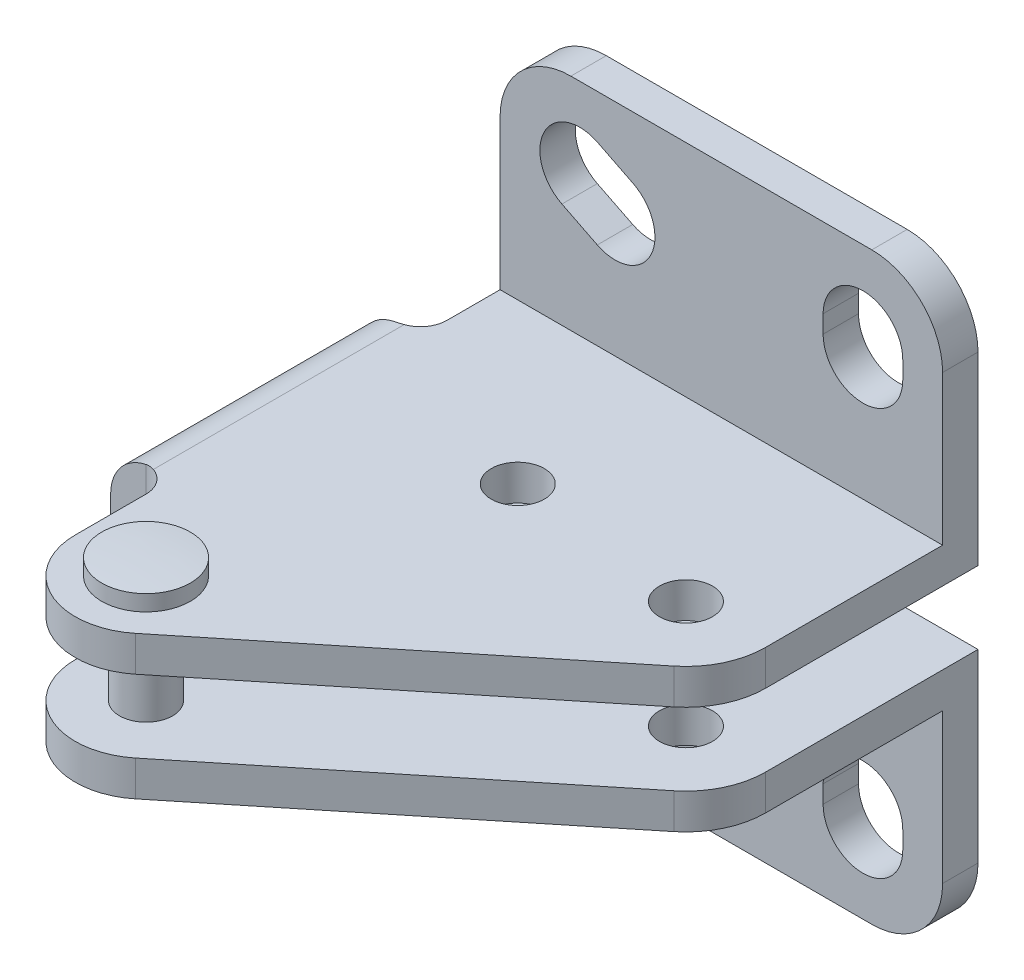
ISO-10303-21;
HEADER;
FILE_DESCRIPTION(('STEP AP214'),'2;1');
FILE_NAME('part.step','',(''),(''),'','','');
FILE_SCHEMA(('AUTOMOTIVE_DESIGN { 1 0 10303 214 1 1 1 1 }'));
ENDSEC;
DATA;
#1=APPLICATION_CONTEXT('core data for automotive mechanical design processes');
#2=APPLICATION_PROTOCOL_DEFINITION('international standard','automotive_design',2000,#1);
#3=PRODUCT_CONTEXT('',#1,'mechanical');
#4=PRODUCT('Part','Part','',(#3));
#5=PRODUCT_RELATED_PRODUCT_CATEGORY('part','',(#4));
#6=PRODUCT_DEFINITION_FORMATION('','',#4);
#7=PRODUCT_DEFINITION_CONTEXT('part definition',#1,'design');
#8=PRODUCT_DEFINITION('design','',#6,#7);
#9=PRODUCT_DEFINITION_SHAPE('','',#8);
#10=(LENGTH_UNIT() NAMED_UNIT(*) SI_UNIT(.MILLI.,.METRE.));
#11=(NAMED_UNIT(*) PLANE_ANGLE_UNIT() SI_UNIT($,.RADIAN.));
#12=(NAMED_UNIT(*) SI_UNIT($,.STERADIAN.) SOLID_ANGLE_UNIT());
#13=UNCERTAINTY_MEASURE_WITH_UNIT(LENGTH_MEASURE(1.E-05),#10,'distance_accuracy_value','');
#14=(GEOMETRIC_REPRESENTATION_CONTEXT(3) GLOBAL_UNCERTAINTY_ASSIGNED_CONTEXT((#13)) GLOBAL_UNIT_ASSIGNED_CONTEXT((#10,
#11,#12)) REPRESENTATION_CONTEXT('',''));
#15=CARTESIAN_POINT('',(0.,0.,0.));
#16=DIRECTION('',(0.,0.,1.));
#17=DIRECTION('',(1.,0.,0.));
#18=AXIS2_PLACEMENT_3D('',#15,#16,#17);
#19=CARTESIAN_POINT('',(-0.5,8.45000000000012,26.));
#20=DIRECTION('',(0.,-1.,0.));
#21=DIRECTION('',(-1.,0.,0.));
#22=AXIS2_PLACEMENT_3D('',#19,#20,#21);
#23=CONICAL_SURFACE('',#22,0.85,1.04719755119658);
#24=CARTESIAN_POINT('',(-0.5,8.94074772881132,26.));
#25=VERTEX_POINT('',#24);
#26=VERTEX_LOOP('',#25);
#27=FACE_BOUND('',#26,.T.);
#28=CARTESIAN_POINT('',(-0.5,8.45000000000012,26.));
#29=DIRECTION('',(0.,1.,0.));
#30=DIRECTION('',(1.,0.,0.));
#31=AXIS2_PLACEMENT_3D('',#28,#29,#30);
#32=CIRCLE('',#31,0.85);
#33=CARTESIAN_POINT('',(0.35,8.45000000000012,26.));
#34=VERTEX_POINT('',#33);
#35=EDGE_CURVE('E589',#34,#34,#32,.T.);
#36=ORIENTED_EDGE('',*,*,#35,.F.);
#37=EDGE_LOOP('',(#36));
#38=FACE_BOUND('',#37,.T.);
#39=ADVANCED_FACE('F14',(#27,#38),#23,.F.);
#40=CARTESIAN_POINT('',(-0.5,8.94074772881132,26.));
#41=DIRECTION('',(0.,1.,0.));
#42=DIRECTION('',(1.,0.,0.));
#43=AXIS2_PLACEMENT_3D('',#40,#41,#42);
#44=CYLINDRICAL_SURFACE('',#43,0.85000000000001);
#45=ORIENTED_EDGE('',*,*,#35,.T.);
#46=EDGE_LOOP('',(#45));
#47=FACE_BOUND('',#46,.T.);
#48=CARTESIAN_POINT('',(-0.5,6.96204408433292,26.));
#49=DIRECTION('',(0.,1.,0.));
#50=DIRECTION('',(1.,0.,0.));
#51=AXIS2_PLACEMENT_3D('',#48,#49,#50);
#52=CIRCLE('',#51,0.85000000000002);
#53=CARTESIAN_POINT('',(-0.5,6.96204408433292,25.1499999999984));
#54=VERTEX_POINT('',#53);
#55=EDGE_CURVE('E2167',#54,#54,#52,.T.);
#56=ORIENTED_EDGE('',*,*,#55,.F.);
#57=EDGE_LOOP('',(#56));
#58=FACE_BOUND('',#57,.T.);
#59=ADVANCED_FACE('F1739',(#47,#58),#44,.F.);
#60=CARTESIAN_POINT('',(-0.5,36.9499999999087,25.9999999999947));
#61=DIRECTION('',(0.,1.,0.));
#62=DIRECTION('',(0.,0.,-1.));
#63=AXIS2_PLACEMENT_3D('',#60,#61,#62);
#64=SPHERICAL_SURFACE('',#63,29.9999999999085);
#65=CARTESIAN_POINT('',(-0.5,7.05434814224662,26.));
#66=DIRECTION('',(0.,1.,0.));
#67=DIRECTION('',(1.,0.,0.));
#68=AXIS2_PLACEMENT_3D('',#65,#66,#67);
#69=CIRCLE('',#68,2.5);
#70=CARTESIAN_POINT('',(-0.5,7.05434814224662,23.4999999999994));
#71=VERTEX_POINT('',#70);
#72=EDGE_CURVE('E2170',#71,#71,#69,.T.);
#73=CARTESIAN_POINT('',(-0.5,6.96204408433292,25.1499999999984));
#74=CARTESIAN_POINT('',(-0.5,6.96253188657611,25.1327903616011));
#75=CARTESIAN_POINT('',(-0.5,6.96303450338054,25.1155811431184));
#76=CARTESIAN_POINT('',(-0.5,6.96406936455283,25.0811635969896));
#77=CARTESIAN_POINT('',(-0.5,6.96460160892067,25.0639552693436));
#78=CARTESIAN_POINT('',(-0.5,6.96569572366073,25.029539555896));
#79=CARTESIAN_POINT('',(-0.5,6.96625759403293,25.0123321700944));
#80=CARTESIAN_POINT('',(-0.5,6.96741095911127,24.9779183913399));
#81=CARTESIAN_POINT('',(-0.5,6.96800245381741,24.9607119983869));
#82=CARTESIAN_POINT('',(-0.5,6.96921506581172,24.926300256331));
#83=CARTESIAN_POINT('',(-0.5,6.96983618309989,24.9090949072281));
#84=CARTESIAN_POINT('',(-0.5,6.97110803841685,24.8746853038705));
#85=CARTESIAN_POINT('',(-0.5,6.97175877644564,24.8574810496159));
#86=CARTESIAN_POINT('',(-0.5,6.97308987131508,24.8230736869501));
#87=CARTESIAN_POINT('',(-0.5,6.97377022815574,24.8058705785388));
#88=CARTESIAN_POINT('',(-0.5,6.97516055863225,24.7714655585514));
#89=CARTESIAN_POINT('',(-0.5,6.9758705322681,24.7542636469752));
#90=CARTESIAN_POINT('',(-0.5,6.97732009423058,24.7198610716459));
#91=CARTESIAN_POINT('',(-0.5,6.97805968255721,24.7026604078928));
#92=CARTESIAN_POINT('',(-0.5,6.97956847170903,24.6682603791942));
#93=CARTESIAN_POINT('',(-0.5,6.98033767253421,24.6510610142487));
#94=CARTESIAN_POINT('',(-0.5,6.98190568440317,24.6166636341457));
#95=CARTESIAN_POINT('',(-0.5,6.98270449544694,24.5994656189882));
#96=CARTESIAN_POINT('',(-0.5,6.98433172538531,24.565070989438));
#97=CARTESIAN_POINT('',(-0.5,6.9851601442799,24.5478743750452));
#98=CARTESIAN_POINT('',(-0.5,6.98684658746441,24.5134825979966));
#99=CARTESIAN_POINT('',(-0.5,6.98770461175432,24.4962874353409));
#100=CARTESIAN_POINT('',(-0.5,6.98945026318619,24.4618986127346));
#101=CARTESIAN_POINT('',(-0.5,6.99033789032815,24.444704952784));
#102=CARTESIAN_POINT('',(-0.5,6.9921427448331,24.4103191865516));
#103=CARTESIAN_POINT('',(-0.5,6.99305997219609,24.3931270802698));
#104=CARTESIAN_POINT('',(-0.5,6.99492402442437,24.3587444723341));
#105=CARTESIAN_POINT('',(-0.5,6.99587084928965,24.3415539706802));
#106=CARTESIAN_POINT('',(-0.5,6.99779409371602,24.3071746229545));
#107=CARTESIAN_POINT('',(-0.5,6.99877051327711,24.2899857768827));
#108=CARTESIAN_POINT('',(-0.5,7.0007529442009,24.2556097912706));
#109=CARTESIAN_POINT('',(-0.5,7.0017589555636,24.2384226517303));
#110=CARTESIAN_POINT('',(-0.5,7.00380056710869,24.2040501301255));
#111=CARTESIAN_POINT('',(-0.5,7.00483616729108,24.186864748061));
#112=CARTESIAN_POINT('',(-0.5,7.00693695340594,24.1524957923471));
#113=CARTESIAN_POINT('',(-0.5,7.00800213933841,24.1353122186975));
#114=CARTESIAN_POINT('',(-0.5,7.01016209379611,24.1009469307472));
#115=CARTESIAN_POINT('',(-0.5,7.01125686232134,24.0837652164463));
#116=CARTESIAN_POINT('',(-0.5,7.01347597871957,24.0494036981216));
#117=CARTESIAN_POINT('',(-0.5,7.01460032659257,24.0322238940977));
#118=CARTESIAN_POINT('',(-0.5,7.01687859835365,23.9978662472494));
#119=CARTESIAN_POINT('',(-0.5,7.01803252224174,23.980688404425));
#120=CARTESIAN_POINT('',(-0.5,7.02036994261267,23.9463347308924));
#121=CARTESIAN_POINT('',(-0.5,7.02155343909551,23.9291589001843));
#122=CARTESIAN_POINT('',(-0.5,7.02395000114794,23.8948093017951));
#123=CARTESIAN_POINT('',(-0.5,7.02516306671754,23.877635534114));
#124=CARTESIAN_POINT('',(-0.5,7.02761876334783,23.8432901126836));
#125=CARTESIAN_POINT('',(-0.5,7.02886139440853,23.8261184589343));
#126=CARTESIAN_POINT('',(-0.5,7.03137621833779,23.7917773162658));
#127=CARTESIAN_POINT('',(-0.5,7.03264841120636,23.7746078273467));
#128=CARTESIAN_POINT('',(-0.5,7.03522235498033,23.7402710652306));
#129=CARTESIAN_POINT('',(-0.5,7.03652410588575,23.7231037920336));
#130=CARTESIAN_POINT('',(-0.5,7.03915716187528,23.6887715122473));
#131=CARTESIAN_POINT('',(-0.5,7.0404884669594,23.6716065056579));
#132=CARTESIAN_POINT('',(-0.5,7.0431806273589,23.6372788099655));
#133=CARTESIAN_POINT('',(-0.5,7.04454148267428,23.6201161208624));
#134=CARTESIAN_POINT('',(-0.5,7.04729273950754,23.5857931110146));
#135=CARTESIAN_POINT('',(-0.5,7.04868314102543,23.56863279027));
#136=CARTESIAN_POINT('',(-0.5,7.05149348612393,23.5343145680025));
#137=CARTESIAN_POINT('',(-0.5,7.05291342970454,23.5171566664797));
#138=CARTESIAN_POINT('',(-0.5,7.05434814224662,23.4999999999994));
#139=B_SPLINE_CURVE_WITH_KNOTS('',3,(#73,#74,#75,#76,#77,#78,#79,#80,#81,#82,#83,#84,#85,#86,
#87,#88,#89,#90,#91,#92,#93,#94,#95,#96,#97,#98,#99,#100,#101,#102,#103,#104,#105,#106,#107,
#108,#109,#110,#111,#112,#113,#114,#115,#116,#117,#118,#119,#120,#121,#122,#123,#124,#125,#126,
#127,#128,#129,#130,#131,#132,#133,#134,#135,#136,#137,#138),.UNSPECIFIED.,.F.,.F.,(4,2,2,2,2,2,
2,2,2,2,2,2,2,2,2,2,2,2,2,2,2,2,2,2,2,2,2,2,2,2,2,2,4),(0.,0.0516496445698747,0.10329928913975,
0.15494893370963,0.206598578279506,0.25824822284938,0.309897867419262,0.361547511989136,
0.413197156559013,0.464846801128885,0.516496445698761,0.568146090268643,0.619795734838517,
0.671445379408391,0.723095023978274,0.774744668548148,0.826394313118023,0.878043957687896,
0.929693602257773,0.981343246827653,1.03299289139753,1.0846425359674,1.13629218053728,
1.18794182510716,1.23959146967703,1.29124111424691,1.34289075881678,1.39454040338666,
1.44619004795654,1.49783969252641,1.5494893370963,1.60113898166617,1.65278862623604),.UNSPECIFIED.);
#140=EDGE_CURVE('BSEAM1728',#54,#71,#139,.T.);
#141=ORIENTED_EDGE('',*,*,#55,.T.);
#142=ORIENTED_EDGE('',*,*,#72,.F.);
#143=ORIENTED_EDGE('',*,*,#140,.T.);
#144=ORIENTED_EDGE('',*,*,#140,.F.);
#145=EDGE_LOOP('',(#141,#143,#142,#144));
#146=FACE_BOUND('',#145,.T.);
#147=ADVANCED_FACE('F1728',(#146),#64,.T.);
#148=CARTESIAN_POINT('',(-0.5,8.94074772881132,26.));
#149=DIRECTION('',(0.,1.,0.));
#150=DIRECTION('',(1.,0.,0.));
#151=AXIS2_PLACEMENT_3D('',#148,#149,#150);
#152=CYLINDRICAL_SURFACE('',#151,2.5);
#153=ORIENTED_EDGE('',*,*,#72,.T.);
#154=EDGE_LOOP('',(#153));
#155=FACE_BOUND('',#154,.T.);
#156=CARTESIAN_POINT('',(-0.5,7.95000000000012,26.));
#157=DIRECTION('',(0.,1.,0.));
#158=DIRECTION('',(1.,0.,0.));
#159=AXIS2_PLACEMENT_3D('',#156,#157,#158);
#160=CIRCLE('',#159,2.5);
#161=CARTESIAN_POINT('',(2.,7.95000000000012,26.));
#162=VERTEX_POINT('',#161);
#163=EDGE_CURVE('E2175',#162,#162,#160,.T.);
#164=ORIENTED_EDGE('',*,*,#163,.F.);
#165=EDGE_LOOP('',(#164));
#166=FACE_BOUND('',#165,.T.);
#167=ADVANCED_FACE('F1717',(#155,#166),#152,.T.);
#168=CARTESIAN_POINT('',(-0.5,8.94074772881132,26.));
#169=DIRECTION('',(0.,1.,0.));
#170=DIRECTION('',(1.,0.,0.));
#171=AXIS2_PLACEMENT_3D('',#168,#169,#170);
#172=CYLINDRICAL_SURFACE('',#171,1.5);
#173=CARTESIAN_POINT('',(-0.5,14.0500000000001,26.));
#174=DIRECTION('',(0.,-1.,0.));
#175=DIRECTION('',(1.,0.,0.));
#176=AXIS2_PLACEMENT_3D('',#173,#174,#175);
#177=CIRCLE('',#176,1.5);
#178=CARTESIAN_POINT('',(1.,14.0500000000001,26.));
#179=VERTEX_POINT('',#178);
#180=EDGE_CURVE('E24',#179,#179,#177,.F.);
#181=ORIENTED_EDGE('',*,*,#180,.F.);
#182=EDGE_LOOP('',(#181));
#183=FACE_BOUND('',#182,.T.);
#184=CARTESIAN_POINT('',(-0.5,9.95000000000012,26.));
#185=DIRECTION('',(0.,1.,0.));
#186=DIRECTION('',(-1.,0.,0.));
#187=AXIS2_PLACEMENT_3D('',#184,#185,#186);
#188=CIRCLE('',#187,1.5);
#189=CARTESIAN_POINT('',(-2.,9.95000000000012,26.));
#190=VERTEX_POINT('',#189);
#191=EDGE_CURVE('E9',#190,#190,#188,.T.);
#192=ORIENTED_EDGE('',*,*,#191,.T.);
#193=EDGE_LOOP('',(#192));
#194=FACE_BOUND('',#193,.T.);
#195=ADVANCED_FACE('F1707',(#183,#194),#172,.T.);
#196=CARTESIAN_POINT('',(-0.5,-12.9499999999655,25.9999999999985));
#197=DIRECTION('',(0.,1.,0.));
#198=DIRECTION('',(0.,0.,1.));
#199=AXIS2_PLACEMENT_3D('',#196,#197,#198);
#200=SPHERICAL_SURFACE('',#199,29.9999999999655);
#201=CARTESIAN_POINT('',(-0.5,16.9456518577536,26.));
#202=DIRECTION('',(0.,1.,0.));
#203=DIRECTION('',(1.,0.,0.));
#204=AXIS2_PLACEMENT_3D('',#201,#202,#203);
#205=CIRCLE('',#204,2.5);
#206=CARTESIAN_POINT('',(2.,16.9456518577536,26.));
#207=VERTEX_POINT('',#206);
#208=EDGE_CURVE('E599',#207,#207,#205,.T.);
#209=ORIENTED_EDGE('',*,*,#208,.T.);
#210=EDGE_LOOP('',(#209));
#211=FACE_BOUND('',#210,.T.);
#212=ADVANCED_FACE('F1085',(#211),#200,.T.);
#213=CARTESIAN_POINT('',(-0.5,8.94074772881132,26.));
#214=DIRECTION('',(0.,1.,0.));
#215=DIRECTION('',(1.,0.,0.));
#216=AXIS2_PLACEMENT_3D('',#213,#214,#215);
#217=CYLINDRICAL_SURFACE('',#216,2.5);
#218=CARTESIAN_POINT('',(-0.5,16.05,26.));
#219=DIRECTION('',(0.,1.,0.));
#220=DIRECTION('',(1.,0.,0.));
#221=AXIS2_PLACEMENT_3D('',#218,#219,#220);
#222=CIRCLE('',#221,2.5);
#223=CARTESIAN_POINT('',(2.,16.05,26.));
#224=VERTEX_POINT('',#223);
#225=EDGE_CURVE('E2178',#224,#224,#222,.T.);
#226=ORIENTED_EDGE('',*,*,#225,.T.);
#227=EDGE_LOOP('',(#226));
#228=FACE_BOUND('',#227,.T.);
#229=ORIENTED_EDGE('',*,*,#208,.F.);
#230=EDGE_LOOP('',(#229));
#231=FACE_BOUND('',#230,.T.);
#232=ADVANCED_FACE('F1078',(#228,#231),#217,.T.);
#233=CARTESIAN_POINT('',(-6.,13.5500000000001,32.));
#234=DIRECTION('',(1.,0.,0.));
#235=DIRECTION('',(0.,1.,0.));
#236=AXIS2_PLACEMENT_3D('',#233,#234,#235);
#237=PLANE('',#236);
#238=DIRECTION('',(0.,0.,-1.));
#239=VECTOR('',#238,1.);
#240=CARTESIAN_POINT('',(-6.,13.5499999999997,32.));
#241=LINE('',#240,#239);
#242=CARTESIAN_POINT('',(-6.,13.5499999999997,20.5));
#243=VERTEX_POINT('',#242);
#244=CARTESIAN_POINT('',(-6.,13.5499999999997,6.5));
#245=VERTEX_POINT('',#244);
#246=EDGE_CURVE('E684',#243,#245,#241,.T.);
#247=ORIENTED_EDGE('',*,*,#246,.F.);
#248=DIRECTION('',(0.,1.,0.));
#249=VECTOR('',#248,1.);
#250=CARTESIAN_POINT('',(-6.,7.95000000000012,20.5));
#251=LINE('',#250,#249);
#252=CARTESIAN_POINT('',(-6.,10.4500000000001,20.5));
#253=VERTEX_POINT('',#252);
#254=EDGE_CURVE('E723',#253,#243,#251,.T.);
#255=ORIENTED_EDGE('',*,*,#254,.F.);
#256=DIRECTION('',(0.,0.,-1.));
#257=VECTOR('',#256,1.);
#258=CARTESIAN_POINT('',(-6.,10.4500000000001,32.));
#259=LINE('',#258,#257);
#260=CARTESIAN_POINT('',(-6.,10.4500000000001,6.5));
#261=VERTEX_POINT('',#260);
#262=EDGE_CURVE('E636',#253,#261,#259,.T.);
#263=ORIENTED_EDGE('',*,*,#262,.T.);
#264=DIRECTION('',(0.,-1.,0.));
#265=VECTOR('',#264,1.);
#266=CARTESIAN_POINT('',(-6.,7.95000000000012,6.5));
#267=LINE('',#266,#265);
#268=EDGE_CURVE('E570',#245,#261,#267,.T.);
#269=ORIENTED_EDGE('',*,*,#268,.F.);
#270=EDGE_LOOP('',(#247,#255,#263,#269));
#271=FACE_BOUND('',#270,.T.);
#272=ADVANCED_FACE('F578',(#271),#237,.T.);
#273=CARTESIAN_POINT('',(-8.,7.95000000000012,6.5));
#274=DIRECTION('',(-1.,0.,0.));
#275=DIRECTION('',(0.,-1.,0.));
#276=AXIS2_PLACEMENT_3D('',#273,#274,#275);
#277=PLANE('',#276);
#278=DIRECTION('',(0.,0.,-1.));
#279=VECTOR('',#278,1.);
#280=CARTESIAN_POINT('',(-8.,10.4500000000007,34.));
#281=LINE('',#280,#279);
#282=CARTESIAN_POINT('',(-8.,10.4500000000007,20.5));
#283=VERTEX_POINT('',#282);
#284=CARTESIAN_POINT('',(-8.,10.4500000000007,6.5));
#285=VERTEX_POINT('',#284);
#286=EDGE_CURVE('E488',#283,#285,#281,.T.);
#287=ORIENTED_EDGE('',*,*,#286,.F.);
#288=DIRECTION('',(0.,1.,0.));
#289=VECTOR('',#288,1.);
#290=CARTESIAN_POINT('',(-8.,7.95000000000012,20.5));
#291=LINE('',#290,#289);
#292=CARTESIAN_POINT('',(-8.,13.5500000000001,20.5));
#293=VERTEX_POINT('',#292);
#294=EDGE_CURVE('E719',#283,#293,#291,.T.);
#295=ORIENTED_EDGE('',*,*,#294,.T.);
#296=DIRECTION('',(0.,0.,-1.));
#297=VECTOR('',#296,1.);
#298=CARTESIAN_POINT('',(-8.,13.5500000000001,34.));
#299=LINE('',#298,#297);
#300=CARTESIAN_POINT('',(-8.,13.5500000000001,6.5));
#301=VERTEX_POINT('',#300);
#302=EDGE_CURVE('E485',#293,#301,#299,.T.);
#303=ORIENTED_EDGE('',*,*,#302,.T.);
#304=DIRECTION('',(0.,1.,0.));
#305=VECTOR('',#304,1.);
#306=CARTESIAN_POINT('',(-8.,7.95000000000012,6.5));
#307=LINE('',#306,#305);
#308=EDGE_CURVE('E726',#285,#301,#307,.T.);
#309=ORIENTED_EDGE('',*,*,#308,.F.);
#310=EDGE_LOOP('',(#287,#295,#303,#309));
#311=FACE_BOUND('',#310,.T.);
#312=ADVANCED_FACE('F945',(#311),#277,.T.);
#313=CARTESIAN_POINT('',(-8.,7.95000000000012,20.5));
#314=DIRECTION('',(0.,0.,1.));
#315=DIRECTION('',(0.,1.,0.));
#316=AXIS2_PLACEMENT_3D('',#313,#314,#315);
#317=PLANE('',#316);
#318=ORIENTED_EDGE('',*,*,#294,.F.);
#319=CARTESIAN_POINT('',(-5.49999999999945,10.4500000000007,20.5));
#320=DIRECTION('',(0.,0.,1.));
#321=DIRECTION('',(0.,1.,0.));
#322=AXIS2_PLACEMENT_3D('',#319,#320,#321);
#323=CIRCLE('',#322,2.50000000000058);
#324=CARTESIAN_POINT('',(-6.,8.00051025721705,20.5));
#325=VERTEX_POINT('',#324);
#326=EDGE_CURVE('E533',#283,#325,#323,.T.);
#327=ORIENTED_EDGE('',*,*,#326,.T.);
#328=EDGE_CURVE('E716',#325,#253,#251,.T.);
#329=ORIENTED_EDGE('',*,*,#328,.T.);
#330=ORIENTED_EDGE('',*,*,#254,.T.);
#331=CARTESIAN_POINT('',(-6.,15.9994897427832,20.5));
#332=VERTEX_POINT('',#331);
#333=EDGE_CURVE('E725',#243,#332,#251,.T.);
#334=ORIENTED_EDGE('',*,*,#333,.T.);
#335=CARTESIAN_POINT('',(-5.49999999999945,13.5499999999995,20.5));
#336=DIRECTION('',(0.,0.,1.));
#337=DIRECTION('',(0.,1.,0.));
#338=AXIS2_PLACEMENT_3D('',#335,#336,#337);
#339=CIRCLE('',#338,2.50000000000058);
#340=EDGE_CURVE('E493',#332,#293,#339,.T.);
#341=ORIENTED_EDGE('',*,*,#340,.T.);
#342=EDGE_LOOP('',(#318,#327,#329,#330,#334,#341));
#343=FACE_BOUND('',#342,.T.);
#344=ADVANCED_FACE('F714',(#343),#317,.T.);
#345=CARTESIAN_POINT('',(0.993769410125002,3.01246117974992,2.));
#346=DIRECTION('',(0.447213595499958,-0.894427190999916,0.));
#347=DIRECTION('',(0.894427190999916,0.447213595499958,0.));
#348=AXIS2_PLACEMENT_3D('',#345,#346,#347);
#349=PLANE('',#348);
#350=DIRECTION('',(-0.894427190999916,-0.447213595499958,0.));
#351=VECTOR('',#350,1.);
#352=CARTESIAN_POINT('',(0.993769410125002,3.01246117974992,0.));
#353=LINE('',#352,#351);
#354=CARTESIAN_POINT('',(0.993769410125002,3.01246117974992,0.));
#355=VERTEX_POINT('',#354);
#356=CARTESIAN_POINT('',(-1.006230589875,2.01246117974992,0.));
#357=VERTEX_POINT('',#356);
#358=EDGE_CURVE('E403',#355,#357,#353,.T.);
#359=ORIENTED_EDGE('',*,*,#358,.F.);
#360=DIRECTION('',(0.,0.,-1.));
#361=VECTOR('',#360,1.);
#362=CARTESIAN_POINT('',(0.993769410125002,3.01246117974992,2.));
#363=LINE('',#362,#361);
#364=CARTESIAN_POINT('',(0.993769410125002,3.01246117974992,2.));
#365=VERTEX_POINT('',#364);
#366=EDGE_CURVE('E428',#365,#355,#363,.T.);
#367=ORIENTED_EDGE('',*,*,#366,.F.);
#368=DIRECTION('',(-0.894427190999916,-0.447213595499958,0.));
#369=VECTOR('',#368,1.);
#370=CARTESIAN_POINT('',(0.993769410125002,3.01246117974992,2.));
#371=LINE('',#370,#369);
#372=CARTESIAN_POINT('',(-1.006230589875,2.01246117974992,2.));
#373=VERTEX_POINT('',#372);
#374=EDGE_CURVE('E417',#365,#373,#371,.T.);
#375=ORIENTED_EDGE('',*,*,#374,.T.);
#376=DIRECTION('',(0.,0.,-1.));
#377=VECTOR('',#376,1.);
#378=CARTESIAN_POINT('',(-1.006230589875,2.01246117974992,2.));
#379=LINE('',#378,#377);
#380=EDGE_CURVE('E426',#373,#357,#379,.T.);
#381=ORIENTED_EDGE('',*,*,#380,.T.);
#382=EDGE_LOOP('',(#359,#367,#375,#381));
#383=FACE_BOUND('',#382,.T.);
#384=ADVANCED_FACE('F1010',(#383),#349,.T.);
#385=CARTESIAN_POINT('',(0.,0.,2.));
#386=DIRECTION('',(0.,0.,-1.));
#387=DIRECTION('',(0.,-1.,0.));
#388=AXIS2_PLACEMENT_3D('',#385,#386,#387);
#389=CYLINDRICAL_SURFACE('',#388,2.25000000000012);
#390=CARTESIAN_POINT('',(0.,0.,0.));
#391=DIRECTION('',(0.,0.,1.));
#392=DIRECTION('',(1.,0.,0.));
#393=AXIS2_PLACEMENT_3D('',#390,#391,#392);
#394=CIRCLE('',#393,2.25000000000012);
#395=CARTESIAN_POINT('',(1.006230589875,-2.01246117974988,0.));
#396=VERTEX_POINT('',#395);
#397=EDGE_CURVE('E407',#357,#396,#394,.T.);
#398=ORIENTED_EDGE('',*,*,#397,.F.);
#399=ORIENTED_EDGE('',*,*,#380,.F.);
#400=CARTESIAN_POINT('',(0.,0.,2.));
#401=DIRECTION('',(0.,0.,1.));
#402=DIRECTION('',(1.,0.,0.));
#403=AXIS2_PLACEMENT_3D('',#400,#401,#402);
#404=CIRCLE('',#403,2.25000000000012);
#405=CARTESIAN_POINT('',(1.006230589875,-2.01246117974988,2.));
#406=VERTEX_POINT('',#405);
#407=EDGE_CURVE('E420',#373,#406,#404,.T.);
#408=ORIENTED_EDGE('',*,*,#407,.T.);
#409=DIRECTION('',(0.,0.,-1.));
#410=VECTOR('',#409,1.);
#411=CARTESIAN_POINT('',(1.006230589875,-2.01246117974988,2.));
#412=LINE('',#411,#410);
#413=EDGE_CURVE('E422',#406,#396,#412,.T.);
#414=ORIENTED_EDGE('',*,*,#413,.T.);
#415=EDGE_LOOP('',(#398,#399,#408,#414));
#416=FACE_BOUND('',#415,.T.);
#417=ADVANCED_FACE('F1006',(#416),#389,.F.);
#418=CARTESIAN_POINT('',(1.006230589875,-2.01246117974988,2.));
#419=DIRECTION('',(-0.447213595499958,0.894427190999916,0.));
#420=DIRECTION('',(-0.894427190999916,-0.447213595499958,0.));
#421=AXIS2_PLACEMENT_3D('',#418,#419,#420);
#422=PLANE('',#421);
#423=DIRECTION('',(0.894427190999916,0.447213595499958,0.));
#424=VECTOR('',#423,1.);
#425=CARTESIAN_POINT('',(1.006230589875,-2.01246117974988,0.));
#426=LINE('',#425,#424);
#427=CARTESIAN_POINT('',(3.006230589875,-1.01246117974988,0.));
#428=VERTEX_POINT('',#427);
#429=EDGE_CURVE('E398',#396,#428,#426,.T.);
#430=ORIENTED_EDGE('',*,*,#429,.F.);
#431=ORIENTED_EDGE('',*,*,#413,.F.);
#432=DIRECTION('',(0.894427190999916,0.447213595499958,0.));
#433=VECTOR('',#432,1.);
#434=CARTESIAN_POINT('',(1.006230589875,-2.01246117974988,2.));
#435=LINE('',#434,#433);
#436=CARTESIAN_POINT('',(3.006230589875,-1.01246117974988,2.));
#437=VERTEX_POINT('',#436);
#438=EDGE_CURVE('E411',#406,#437,#435,.T.);
#439=ORIENTED_EDGE('',*,*,#438,.T.);
#440=DIRECTION('',(0.,0.,-1.));
#441=VECTOR('',#440,1.);
#442=CARTESIAN_POINT('',(3.006230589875,-1.01246117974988,2.));
#443=LINE('',#442,#441);
#444=EDGE_CURVE('E430',#437,#428,#443,.T.);
#445=ORIENTED_EDGE('',*,*,#444,.T.);
#446=EDGE_LOOP('',(#430,#431,#439,#445));
#447=FACE_BOUND('',#446,.T.);
#448=ADVANCED_FACE('F1009',(#447),#422,.T.);
#449=CARTESIAN_POINT('',(2.,1.00000000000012,2.));
#450=DIRECTION('',(0.,0.,-1.));
#451=DIRECTION('',(0.,-1.,0.));
#452=AXIS2_PLACEMENT_3D('',#449,#450,#451);
#453=CYLINDRICAL_SURFACE('',#452,2.25000000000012);
#454=CARTESIAN_POINT('',(2.,1.00000000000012,0.));
#455=DIRECTION('',(0.,0.,1.));
#456=DIRECTION('',(-1.,0.,0.));
#457=AXIS2_PLACEMENT_3D('',#454,#455,#456);
#458=CIRCLE('',#457,2.25000000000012);
#459=EDGE_CURVE('E399',#428,#355,#458,.T.);
#460=ORIENTED_EDGE('',*,*,#459,.F.);
#461=ORIENTED_EDGE('',*,*,#444,.F.);
#462=CARTESIAN_POINT('',(2.,1.00000000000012,2.));
#463=DIRECTION('',(0.,0.,1.));
#464=DIRECTION('',(-1.,0.,0.));
#465=AXIS2_PLACEMENT_3D('',#462,#463,#464);
#466=CIRCLE('',#465,2.25000000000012);
#467=EDGE_CURVE('E415',#437,#365,#466,.T.);
#468=ORIENTED_EDGE('',*,*,#467,.T.);
#469=ORIENTED_EDGE('',*,*,#366,.T.);
#470=EDGE_LOOP('',(#460,#461,#468,#469));
#471=FACE_BOUND('',#470,.T.);
#472=ADVANCED_FACE('F1015',(#471),#453,.F.);
#473=CARTESIAN_POINT('',(16.4999999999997,-0.499999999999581,2.));
#474=DIRECTION('',(0.,0.,-1.));
#475=DIRECTION('',(0.,-1.,0.));
#476=AXIS2_PLACEMENT_3D('',#473,#474,#475);
#477=CYLINDRICAL_SURFACE('',#476,4.00000000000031);
#478=CARTESIAN_POINT('',(16.4999999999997,-0.499999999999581,0.));
#479=DIRECTION('',(0.,0.,1.));
#480=DIRECTION('',(-1.,0.,0.));
#481=AXIS2_PLACEMENT_3D('',#478,#479,#480);
#482=CIRCLE('',#481,4.00000000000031);
#483=CARTESIAN_POINT('',(16.5,-4.49999999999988,0.));
#484=VERTEX_POINT('',#483);
#485=CARTESIAN_POINT('',(20.5,-0.499999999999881,0.));
#486=VERTEX_POINT('',#485);
#487=EDGE_CURVE('E840',#484,#486,#482,.T.);
#488=ORIENTED_EDGE('',*,*,#487,.T.);
#489=DIRECTION('',(0.,0.,-1.));
#490=VECTOR('',#489,1.);
#491=CARTESIAN_POINT('',(20.5,-0.499999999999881,2.));
#492=LINE('',#491,#490);
#493=CARTESIAN_POINT('',(20.5,-0.499999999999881,2.));
#494=VERTEX_POINT('',#493);
#495=EDGE_CURVE('E819',#494,#486,#492,.T.);
#496=ORIENTED_EDGE('',*,*,#495,.F.);
#497=CARTESIAN_POINT('',(16.4999999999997,-0.499999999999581,2.));
#498=DIRECTION('',(0.,0.,1.));
#499=DIRECTION('',(-1.,0.,0.));
#500=AXIS2_PLACEMENT_3D('',#497,#498,#499);
#501=CIRCLE('',#500,4.00000000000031);
#502=CARTESIAN_POINT('',(16.5,-4.49999999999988,2.));
#503=VERTEX_POINT('',#502);
#504=EDGE_CURVE('E822',#503,#494,#501,.T.);
#505=ORIENTED_EDGE('',*,*,#504,.F.);
#506=DIRECTION('',(0.,0.,-1.));
#507=VECTOR('',#506,1.);
#508=CARTESIAN_POINT('',(16.5,-4.49999999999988,2.));
#509=LINE('',#508,#507);
#510=EDGE_CURVE('E816',#503,#484,#509,.T.);
#511=ORIENTED_EDGE('',*,*,#510,.T.);
#512=EDGE_LOOP('',(#488,#496,#505,#511));
#513=FACE_BOUND('',#512,.T.);
#514=ADVANCED_FACE('F612',(#513),#477,.T.);
#515=CARTESIAN_POINT('',(-0.5,-4.49999999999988,2.));
#516=DIRECTION('',(0.,1.,0.));
#517=DIRECTION('',(-1.,0.,0.));
#518=AXIS2_PLACEMENT_3D('',#515,#516,#517);
#519=PLANE('',#518);
#520=DIRECTION('',(1.,0.,0.));
#521=VECTOR('',#520,1.);
#522=CARTESIAN_POINT('',(-0.5,-4.49999999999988,0.));
#523=LINE('',#522,#521);
#524=CARTESIAN_POINT('',(-0.5,-4.49999999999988,0.));
#525=VERTEX_POINT('',#524);
#526=EDGE_CURVE('E844',#525,#484,#523,.T.);
#527=ORIENTED_EDGE('',*,*,#526,.T.);
#528=ORIENTED_EDGE('',*,*,#510,.F.);
#529=DIRECTION('',(1.,0.,0.));
#530=VECTOR('',#529,1.);
#531=CARTESIAN_POINT('',(-0.5,-4.49999999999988,2.));
#532=LINE('',#531,#530);
#533=CARTESIAN_POINT('',(-0.5,-4.49999999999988,2.));
#534=VERTEX_POINT('',#533);
#535=EDGE_CURVE('E828',#534,#503,#532,.T.);
#536=ORIENTED_EDGE('',*,*,#535,.F.);
#537=DIRECTION('',(0.,0.,-1.));
#538=VECTOR('',#537,1.);
#539=CARTESIAN_POINT('',(-0.5,-4.49999999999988,2.));
#540=LINE('',#539,#538);
#541=EDGE_CURVE('E813',#534,#525,#540,.T.);
#542=ORIENTED_EDGE('',*,*,#541,.T.);
#543=EDGE_LOOP('',(#527,#528,#536,#542));
#544=FACE_BOUND('',#543,.T.);
#545=ADVANCED_FACE('F1030',(#544),#519,.F.);
#546=CARTESIAN_POINT('',(16.,1.00000000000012,2.));
#547=DIRECTION('',(0.,0.,-1.));
#548=DIRECTION('',(0.,-1.,0.));
#549=AXIS2_PLACEMENT_3D('',#546,#547,#548);
#550=CYLINDRICAL_SURFACE('',#549,2.25);
#551=CARTESIAN_POINT('',(16.,1.00000000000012,0.));
#552=DIRECTION('',(0.,0.,1.));
#553=DIRECTION('',(1.,0.,0.));
#554=AXIS2_PLACEMENT_3D('',#551,#552,#553);
#555=CIRCLE('',#554,2.25);
#556=CARTESIAN_POINT('',(18.25,1.00000000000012,0.));
#557=VERTEX_POINT('',#556);
#558=CARTESIAN_POINT('',(13.75,1.00000000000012,0.));
#559=VERTEX_POINT('',#558);
#560=EDGE_CURVE('E438',#557,#559,#555,.T.);
#561=ORIENTED_EDGE('',*,*,#560,.F.);
#562=DIRECTION('',(0.,0.,-1.));
#563=VECTOR('',#562,1.);
#564=CARTESIAN_POINT('',(18.25,1.00000000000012,2.));
#565=LINE('',#564,#563);
#566=CARTESIAN_POINT('',(18.25,1.00000000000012,2.));
#567=VERTEX_POINT('',#566);
#568=EDGE_CURVE('E463',#567,#557,#565,.T.);
#569=ORIENTED_EDGE('',*,*,#568,.F.);
#570=CARTESIAN_POINT('',(16.,1.00000000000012,2.));
#571=DIRECTION('',(0.,0.,1.));
#572=DIRECTION('',(1.,0.,0.));
#573=AXIS2_PLACEMENT_3D('',#570,#571,#572);
#574=CIRCLE('',#573,2.25);
#575=CARTESIAN_POINT('',(13.75,1.00000000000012,2.));
#576=VERTEX_POINT('',#575);
#577=EDGE_CURVE('E452',#567,#576,#574,.T.);
#578=ORIENTED_EDGE('',*,*,#577,.T.);
#579=DIRECTION('',(0.,0.,-1.));
#580=VECTOR('',#579,1.);
#581=CARTESIAN_POINT('',(13.75,1.00000000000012,2.));
#582=LINE('',#581,#580);
#583=EDGE_CURVE('E461',#576,#559,#582,.T.);
#584=ORIENTED_EDGE('',*,*,#583,.T.);
#585=EDGE_LOOP('',(#561,#569,#578,#584));
#586=FACE_BOUND('',#585,.T.);
#587=ADVANCED_FACE('F1026',(#586),#550,.F.);
#588=CARTESIAN_POINT('',(13.75,1.00000000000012,2.));
#589=DIRECTION('',(1.,0.,0.));
#590=DIRECTION('',(0.,1.,0.));
#591=AXIS2_PLACEMENT_3D('',#588,#589,#590);
#592=PLANE('',#591);
#593=DIRECTION('',(0.,-1.,0.));
#594=VECTOR('',#593,1.);
#595=CARTESIAN_POINT('',(13.75,1.00000000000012,0.));
#596=LINE('',#595,#594);
#597=CARTESIAN_POINT('',(13.75,1.196959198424E-13,0.));
#598=VERTEX_POINT('',#597);
#599=EDGE_CURVE('E442',#559,#598,#596,.T.);
#600=ORIENTED_EDGE('',*,*,#599,.F.);
#601=ORIENTED_EDGE('',*,*,#583,.F.);
#602=DIRECTION('',(0.,-1.,0.));
#603=VECTOR('',#602,1.);
#604=CARTESIAN_POINT('',(13.75,1.00000000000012,2.));
#605=LINE('',#604,#603);
#606=CARTESIAN_POINT('',(13.75,1.196959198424E-13,2.));
#607=VERTEX_POINT('',#606);
#608=EDGE_CURVE('E455',#576,#607,#605,.T.);
#609=ORIENTED_EDGE('',*,*,#608,.T.);
#610=DIRECTION('',(0.,0.,-1.));
#611=VECTOR('',#610,1.);
#612=CARTESIAN_POINT('',(13.75,1.196959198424E-13,2.));
#613=LINE('',#612,#611);
#614=EDGE_CURVE('E457',#607,#598,#613,.T.);
#615=ORIENTED_EDGE('',*,*,#614,.T.);
#616=EDGE_LOOP('',(#600,#601,#609,#615));
#617=FACE_BOUND('',#616,.T.);
#618=ADVANCED_FACE('F1022',(#617),#592,.T.);
#619=CARTESIAN_POINT('',(16.,1.196959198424E-13,2.));
#620=DIRECTION('',(0.,0.,-1.));
#621=DIRECTION('',(0.,-1.,0.));
#622=AXIS2_PLACEMENT_3D('',#619,#620,#621);
#623=CYLINDRICAL_SURFACE('',#622,2.25);
#624=CARTESIAN_POINT('',(16.,1.196959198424E-13,0.));
#625=DIRECTION('',(0.,0.,1.));
#626=DIRECTION('',(-1.,0.,0.));
#627=AXIS2_PLACEMENT_3D('',#624,#625,#626);
#628=CIRCLE('',#627,2.25);
#629=CARTESIAN_POINT('',(18.25,1.196959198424E-13,0.));
#630=VERTEX_POINT('',#629);
#631=EDGE_CURVE('E433',#598,#630,#628,.T.);
#632=ORIENTED_EDGE('',*,*,#631,.F.);
#633=ORIENTED_EDGE('',*,*,#614,.F.);
#634=CARTESIAN_POINT('',(16.,1.196959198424E-13,2.));
#635=DIRECTION('',(0.,0.,1.));
#636=DIRECTION('',(-1.,0.,0.));
#637=AXIS2_PLACEMENT_3D('',#634,#635,#636);
#638=CIRCLE('',#637,2.25);
#639=CARTESIAN_POINT('',(18.25,1.196959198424E-13,2.));
#640=VERTEX_POINT('',#639);
#641=EDGE_CURVE('E446',#607,#640,#638,.T.);
#642=ORIENTED_EDGE('',*,*,#641,.T.);
#643=DIRECTION('',(0.,0.,-1.));
#644=VECTOR('',#643,1.);
#645=CARTESIAN_POINT('',(18.25,1.196959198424E-13,2.));
#646=LINE('',#645,#644);
#647=EDGE_CURVE('E465',#640,#630,#646,.T.);
#648=ORIENTED_EDGE('',*,*,#647,.T.);
#649=EDGE_LOOP('',(#632,#633,#642,#648));
#650=FACE_BOUND('',#649,.T.);
#651=ADVANCED_FACE('F1025',(#650),#623,.F.);
#652=CARTESIAN_POINT('',(18.25,1.196959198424E-13,2.));
#653=DIRECTION('',(-1.,0.,0.));
#654=DIRECTION('',(0.,-1.,0.));
#655=AXIS2_PLACEMENT_3D('',#652,#653,#654);
#656=PLANE('',#655);
#657=DIRECTION('',(0.,1.,0.));
#658=VECTOR('',#657,1.);
#659=CARTESIAN_POINT('',(18.25,1.196959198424E-13,0.));
#660=LINE('',#659,#658);
#661=EDGE_CURVE('E434',#630,#557,#660,.T.);
#662=ORIENTED_EDGE('',*,*,#661,.F.);
#663=ORIENTED_EDGE('',*,*,#647,.F.);
#664=DIRECTION('',(0.,1.,0.));
#665=VECTOR('',#664,1.);
#666=CARTESIAN_POINT('',(18.25,1.196959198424E-13,2.));
#667=LINE('',#666,#665);
#668=EDGE_CURVE('E450',#640,#567,#667,.T.);
#669=ORIENTED_EDGE('',*,*,#668,.T.);
#670=ORIENTED_EDGE('',*,*,#568,.T.);
#671=EDGE_LOOP('',(#662,#663,#669,#670));
#672=FACE_BOUND('',#671,.T.);
#673=ADVANCED_FACE('F1032',(#672),#656,.T.);
#674=CARTESIAN_POINT('',(-0.499999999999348,-0.49999999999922,2.));
#675=DIRECTION('',(0.,0.,-1.));
#676=DIRECTION('',(0.,-1.,0.));
#677=AXIS2_PLACEMENT_3D('',#674,#675,#676);
#678=CYLINDRICAL_SURFACE('',#677,4.00000000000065);
#679=CARTESIAN_POINT('',(-0.499999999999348,-0.49999999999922,0.));
#680=DIRECTION('',(0.,0.,1.));
#681=DIRECTION('',(-1.,0.,0.));
#682=AXIS2_PLACEMENT_3D('',#679,#680,#681);
#683=CIRCLE('',#682,4.00000000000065);
#684=CARTESIAN_POINT('',(-4.5,-0.499999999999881,0.));
#685=VERTEX_POINT('',#684);
#686=EDGE_CURVE('E847',#685,#525,#683,.T.);
#687=ORIENTED_EDGE('',*,*,#686,.T.);
#688=ORIENTED_EDGE('',*,*,#541,.F.);
#689=CARTESIAN_POINT('',(-0.499999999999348,-0.49999999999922,2.));
#690=DIRECTION('',(0.,0.,1.));
#691=DIRECTION('',(-1.,0.,0.));
#692=AXIS2_PLACEMENT_3D('',#689,#690,#691);
#693=CIRCLE('',#692,4.00000000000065);
#694=CARTESIAN_POINT('',(-4.5,-0.499999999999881,2.));
#695=VERTEX_POINT('',#694);
#696=EDGE_CURVE('E830',#695,#534,#693,.T.);
#697=ORIENTED_EDGE('',*,*,#696,.F.);
#698=DIRECTION('',(0.,0.,-1.));
#699=VECTOR('',#698,1.);
#700=CARTESIAN_POINT('',(-4.5,-0.499999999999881,2.));
#701=LINE('',#700,#699);
#702=EDGE_CURVE('E810',#695,#685,#701,.T.);
#703=ORIENTED_EDGE('',*,*,#702,.T.);
#704=EDGE_LOOP('',(#687,#688,#697,#703));
#705=FACE_BOUND('',#704,.T.);
#706=ADVANCED_FACE('F1035',(#705),#678,.T.);
#707=CARTESIAN_POINT('',(-6.,7.95000000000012,6.5));
#708=DIRECTION('',(0.,0.,-1.));
#709=DIRECTION('',(0.,-1.,0.));
#710=AXIS2_PLACEMENT_3D('',#707,#708,#709);
#711=PLANE('',#710);
#712=DIRECTION('',(0.,1.,0.));
#713=VECTOR('',#712,1.);
#714=CARTESIAN_POINT('',(-6.,7.95000000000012,6.5));
#715=LINE('',#714,#713);
#716=CARTESIAN_POINT('',(-6.,8.00051025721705,6.5));
#717=VERTEX_POINT('',#716);
#718=EDGE_CURVE('E642',#717,#261,#715,.T.);
#719=ORIENTED_EDGE('',*,*,#718,.F.);
#720=CARTESIAN_POINT('',(-5.49999999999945,10.4500000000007,6.5));
#721=DIRECTION('',(0.,0.,-1.));
#722=DIRECTION('',(0.,-1.,0.));
#723=AXIS2_PLACEMENT_3D('',#720,#721,#722);
#724=CIRCLE('',#723,2.50000000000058);
#725=EDGE_CURVE('E700',#717,#285,#724,.T.);
#726=ORIENTED_EDGE('',*,*,#725,.T.);
#727=ORIENTED_EDGE('',*,*,#308,.T.);
#728=CARTESIAN_POINT('',(-5.49999999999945,13.5499999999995,6.5));
#729=DIRECTION('',(0.,0.,-1.));
#730=DIRECTION('',(0.,-1.,0.));
#731=AXIS2_PLACEMENT_3D('',#728,#729,#730);
#732=CIRCLE('',#731,2.50000000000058);
#733=CARTESIAN_POINT('',(-6.,15.9994897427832,6.5));
#734=VERTEX_POINT('',#733);
#735=EDGE_CURVE('E505',#301,#734,#732,.T.);
#736=ORIENTED_EDGE('',*,*,#735,.T.);
#737=EDGE_CURVE('E937',#245,#734,#715,.T.);
#738=ORIENTED_EDGE('',*,*,#737,.F.);
#739=ORIENTED_EDGE('',*,*,#268,.T.);
#740=EDGE_LOOP('',(#719,#726,#727,#736,#738,#739));
#741=FACE_BOUND('',#740,.T.);
#742=ADVANCED_FACE('F545',(#741),#711,.T.);
#743=CARTESIAN_POINT('',(20.5,7.95000000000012,0.));
#744=DIRECTION('',(0.,0.,-1.));
#745=DIRECTION('',(0.,-1.,0.));
#746=AXIS2_PLACEMENT_3D('',#743,#744,#745);
#747=PLANE('',#746);
#748=ORIENTED_EDGE('',*,*,#599,.T.);
#749=ORIENTED_EDGE('',*,*,#631,.T.);
#750=ORIENTED_EDGE('',*,*,#661,.T.);
#751=ORIENTED_EDGE('',*,*,#560,.T.);
#752=EDGE_LOOP('',(#748,#749,#750,#751));
#753=FACE_BOUND('',#752,.T.);
#754=DIRECTION('',(0.,1.,0.));
#755=VECTOR('',#754,1.);
#756=CARTESIAN_POINT('',(-4.5,7.95000000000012,0.));
#757=LINE('',#756,#755);
#758=CARTESIAN_POINT('',(-4.5,9.95000000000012,0.));
#759=VERTEX_POINT('',#758);
#760=EDGE_CURVE('E925',#685,#759,#757,.T.);
#761=ORIENTED_EDGE('',*,*,#760,.T.);
#762=DIRECTION('',(1.,0.,0.));
#763=VECTOR('',#762,1.);
#764=CARTESIAN_POINT('',(-5.5,9.95000000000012,0.));
#765=LINE('',#764,#763);
#766=CARTESIAN_POINT('',(20.5,9.95000000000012,0.));
#767=VERTEX_POINT('',#766);
#768=EDGE_CURVE('E688',#759,#767,#765,.T.);
#769=ORIENTED_EDGE('',*,*,#768,.T.);
#770=DIRECTION('',(0.,1.,0.));
#771=VECTOR('',#770,1.);
#772=CARTESIAN_POINT('',(20.5,7.95000000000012,0.));
#773=LINE('',#772,#771);
#774=EDGE_CURVE('E895',#486,#767,#773,.T.);
#775=ORIENTED_EDGE('',*,*,#774,.F.);
#776=ORIENTED_EDGE('',*,*,#487,.F.);
#777=ORIENTED_EDGE('',*,*,#526,.F.);
#778=ORIENTED_EDGE('',*,*,#686,.F.);
#779=EDGE_LOOP('',(#761,#769,#775,#776,#777,#778));
#780=FACE_BOUND('',#779,.T.);
#781=ORIENTED_EDGE('',*,*,#397,.T.);
#782=ORIENTED_EDGE('',*,*,#429,.T.);
#783=ORIENTED_EDGE('',*,*,#459,.T.);
#784=ORIENTED_EDGE('',*,*,#358,.T.);
#785=EDGE_LOOP('',(#781,#782,#783,#784));
#786=FACE_BOUND('',#785,.T.);
#787=ADVANCED_FACE('F921',(#753,#780,#786),#747,.T.);
#788=CARTESIAN_POINT('',(-5.4999999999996,10.4500000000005,32.));
#789=DIRECTION('',(0.,0.,-1.));
#790=DIRECTION('',(0.,-1.,0.));
#791=AXIS2_PLACEMENT_3D('',#788,#789,#790);
#792=CYLINDRICAL_SURFACE('',#791,0.50000000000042);
#793=ORIENTED_EDGE('',*,*,#262,.F.);
#794=CARTESIAN_POINT('',(-5.5,9.95000000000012,20.5857864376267));
#795=CARTESIAN_POINT('',(-5.52636578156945,9.9499685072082,20.5764335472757));
#796=CARTESIAN_POINT('',(-5.55303347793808,9.95208526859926,20.5678653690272));
#797=CARTESIAN_POINT('',(-5.60614678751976,9.96066519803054,20.5523738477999));
#798=CARTESIAN_POINT('',(-5.63259237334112,9.96712889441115,20.5454507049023));
#799=CARTESIAN_POINT('',(-5.6844846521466,9.98447131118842,20.5333138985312));
#800=CARTESIAN_POINT('',(-5.70992906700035,9.99535952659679,20.5281039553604));
#801=CARTESIAN_POINT('',(-5.75885835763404,10.0213294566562,20.5193017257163));
#802=CARTESIAN_POINT('',(-5.78234470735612,10.0364079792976,20.5157082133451));
#803=CARTESIAN_POINT('',(-5.82595975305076,10.0698878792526,20.5099725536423));
#804=CARTESIAN_POINT('',(-5.84616384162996,10.088184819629,20.5077927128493));
#805=CARTESIAN_POINT('',(-5.88337322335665,10.1278739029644,20.5044238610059));
#806=CARTESIAN_POINT('',(-5.90037721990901,10.149267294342,20.5032352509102));
#807=CARTESIAN_POINT('',(-5.93084480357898,10.1947920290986,20.5015161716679));
#808=CARTESIAN_POINT('',(-5.94426904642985,10.2189499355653,20.5009927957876));
#809=CARTESIAN_POINT('',(-5.96695818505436,10.2691460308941,20.5003209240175));
#810=CARTESIAN_POINT('',(-5.97622440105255,10.2951836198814,20.5001723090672));
#811=CARTESIAN_POINT('',(-5.98882847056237,10.3426946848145,20.500030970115));
#812=CARTESIAN_POINT('',(-5.99301190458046,10.3639481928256,20.5000116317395));
#813=CARTESIAN_POINT('',(-5.9985997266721,10.4067986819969,20.5000000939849));
#814=CARTESIAN_POINT('',(-6.00000649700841,10.428395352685,20.500007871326));
#815=CARTESIAN_POINT('',(-6.,10.4500000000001,20.5));
#816=B_SPLINE_CURVE_WITH_KNOTS('',3,(#794,#795,#796,#797,#798,#799,#800,#801,#802,#803,#804,
#805,#806,#807,#808,#809,#810,#811,#812,#813,#814,#815),.UNSPECIFIED.,.F.,.F.,(4,2,2,2,2,2,2,2,
2,2,4),(0.,0.0838673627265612,0.167744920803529,0.251803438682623,0.335798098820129,
0.417449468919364,0.499133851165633,0.581682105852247,0.664204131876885,0.729013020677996,
0.793766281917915),.UNSPECIFIED.);
#817=CARTESIAN_POINT('',(-5.5,9.95000000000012,20.5857864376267));
#818=VERTEX_POINT('',#817);
#819=EDGE_CURVE('E590',#818,#253,#816,.T.);
#820=ORIENTED_EDGE('',*,*,#819,.F.);
#821=DIRECTION('',(0.,0.,-1.));
#822=VECTOR('',#821,1.);
#823=CARTESIAN_POINT('',(-5.5,9.95000000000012,32.));
#824=LINE('',#823,#822);
#825=CARTESIAN_POINT('',(-5.5,9.95000000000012,6.41421356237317));
#826=VERTEX_POINT('',#825);
#827=EDGE_CURVE('E621',#818,#826,#824,.T.);
#828=ORIENTED_EDGE('',*,*,#827,.T.);
#829=CARTESIAN_POINT('',(-6.,10.4500000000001,6.5));
#830=CARTESIAN_POINT('',(-6.00002385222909,10.4219019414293,6.4999775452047));
#831=CARTESIAN_POINT('',(-5.99763291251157,10.3938106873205,6.49999961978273));
#832=CARTESIAN_POINT('',(-5.98819630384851,10.3384372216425,6.49996690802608));
#833=CARTESIAN_POINT('',(-5.98115336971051,10.3111545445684,6.49991216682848));
#834=CARTESIAN_POINT('',(-5.9625822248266,10.2581444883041,6.49956017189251));
#835=CARTESIAN_POINT('',(-5.95105158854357,10.2324179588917,6.49926278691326));
#836=CARTESIAN_POINT('',(-5.92384639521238,10.1832747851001,6.4981276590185));
#837=CARTESIAN_POINT('',(-5.90817251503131,10.159857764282,6.49729000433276));
#838=CARTESIAN_POINT('',(-5.87322743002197,10.1161116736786,6.49473506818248));
#839=CARTESIAN_POINT('',(-5.85397317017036,10.0957688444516,6.49302186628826));
#840=CARTESIAN_POINT('',(-5.81242841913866,10.058638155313,6.48837245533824));
#841=CARTESIAN_POINT('',(-5.79013871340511,10.0418493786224,6.48543656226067));
#842=CARTESIAN_POINT('',(-5.74370775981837,10.012569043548,6.47812567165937));
#843=CARTESIAN_POINT('',(-5.71960930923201,10.0000024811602,6.47377883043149));
#844=CARTESIAN_POINT('',(-5.66998713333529,9.97901184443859,6.46346605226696));
#845=CARTESIAN_POINT('',(-5.64446318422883,9.97058842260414,6.4574998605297));
#846=CARTESIAN_POINT('',(-5.59897908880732,9.9594758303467,6.44554349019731));
#847=CARTESIAN_POINT('',(-5.57913833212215,9.9558996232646,6.43989601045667));
#848=CARTESIAN_POINT('',(-5.53948085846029,9.95116055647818,6.42771063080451));
#849=CARTESIAN_POINT('',(-5.51966416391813,9.94999329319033,6.42117437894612));
#850=CARTESIAN_POINT('',(-5.5,9.95000000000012,6.41421356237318));
#851=B_SPLINE_CURVE_WITH_KNOTS('',3,(#829,#830,#831,#832,#833,#834,#835,#836,#837,#838,#839,
#840,#841,#842,#843,#844,#845,#846,#847,#848,#849,#850),.UNSPECIFIED.,.F.,.F.,(4,2,2,2,2,2,2,2,
2,2,4),(0.,0.084183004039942,0.168316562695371,0.252495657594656,0.336661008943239,
0.420437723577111,0.50419280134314,0.586369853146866,0.66855984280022,0.731216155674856,
0.79375783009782),.UNSPECIFIED.);
#852=EDGE_CURVE('E551',#261,#826,#851,.T.);
#853=ORIENTED_EDGE('',*,*,#852,.F.);
#854=EDGE_LOOP('',(#793,#820,#828,#853));
#855=FACE_BOUND('',#854,.T.);
#856=ADVANCED_FACE('F518',(#855),#792,.F.);
#857=CARTESIAN_POINT('',(-5.49999999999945,10.4500000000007,34.));
#858=DIRECTION('',(0.,0.,-1.));
#859=DIRECTION('',(0.,-1.,0.));
#860=AXIS2_PLACEMENT_3D('',#857,#858,#859);
#861=CYLINDRICAL_SURFACE('',#860,2.50000000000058);
#862=DIRECTION('',(0.,0.,-1.));
#863=VECTOR('',#862,1.);
#864=CARTESIAN_POINT('',(-5.5,7.95000000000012,34.));
#865=LINE('',#864,#863);
#866=CARTESIAN_POINT('',(-5.5,7.95000000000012,20.585786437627));
#867=VERTEX_POINT('',#866);
#868=CARTESIAN_POINT('',(-5.49999999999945,7.95000000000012,6.41421356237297));
#869=VERTEX_POINT('',#868);
#870=EDGE_CURVE('E490',#867,#869,#865,.T.);
#871=ORIENTED_EDGE('',*,*,#870,.F.);
#872=CARTESIAN_POINT('',(-6.,8.00051025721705,20.5));
#873=CARTESIAN_POINT('',(-5.95790428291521,7.99190554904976,20.4999889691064));
#874=CARTESIAN_POINT('',(-5.91557877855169,7.98440832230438,20.501772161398));
#875=CARTESIAN_POINT('',(-5.83130918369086,7.97169050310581,20.5089244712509));
#876=CARTESIAN_POINT('',(-5.78936534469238,7.96644868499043,20.5142588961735));
#877=CARTESIAN_POINT('',(-5.70587287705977,7.95813785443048,20.5285100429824));
#878=CARTESIAN_POINT('',(-5.66432424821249,7.955068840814,20.5374267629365));
#879=CARTESIAN_POINT('',(-5.58163649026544,7.95098445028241,20.5588816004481));
#880=CARTESIAN_POINT('',(-5.54050527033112,7.94998933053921,20.5714540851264));
#881=CARTESIAN_POINT('',(-5.5,7.95000000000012,20.5857864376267));
#882=B_SPLINE_CURVE_WITH_KNOTS('',3,(#872,#873,#874,#875,#876,#877,#878,#879,#880,#881),
.UNSPECIFIED.,.F.,.F.,(4,2,2,2,4),(0.,0.128851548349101,0.256462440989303,0.384073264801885,
0.51292482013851),.UNSPECIFIED.);
#883=EDGE_CURVE('E702',#325,#867,#882,.T.);
#884=ORIENTED_EDGE('',*,*,#883,.F.);
#885=ORIENTED_EDGE('',*,*,#326,.F.);
#886=ORIENTED_EDGE('',*,*,#286,.T.);
#887=ORIENTED_EDGE('',*,*,#725,.F.);
#888=CARTESIAN_POINT('',(-5.5,7.95000000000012,6.41421356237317));
#889=CARTESIAN_POINT('',(-5.54050527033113,7.94998933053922,6.42854591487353));
#890=CARTESIAN_POINT('',(-5.58163649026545,7.95098445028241,6.44111839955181));
#891=CARTESIAN_POINT('',(-5.6643242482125,7.955068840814,6.46257323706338));
#892=CARTESIAN_POINT('',(-5.70587287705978,7.95813785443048,6.47148995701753));
#893=CARTESIAN_POINT('',(-5.78936534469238,7.96644868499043,6.48574110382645));
#894=CARTESIAN_POINT('',(-5.83130918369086,7.97169050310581,6.4910755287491));
#895=CARTESIAN_POINT('',(-5.91557877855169,7.98440832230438,6.49822783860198));
#896=CARTESIAN_POINT('',(-5.95790428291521,7.99190554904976,6.50001103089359));
#897=CARTESIAN_POINT('',(-6.,8.00051025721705,6.5));
#898=B_SPLINE_CURVE_WITH_KNOTS('',3,(#888,#889,#890,#891,#892,#893,#894,#895,#896,#897),
.UNSPECIFIED.,.F.,.F.,(4,2,2,2,4),(0.,0.128851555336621,0.256462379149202,0.38407327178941,
0.512924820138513),.UNSPECIFIED.);
#899=EDGE_CURVE('E692',#869,#717,#898,.T.);
#900=ORIENTED_EDGE('',*,*,#899,.F.);
#901=EDGE_LOOP('',(#871,#884,#885,#886,#887,#900));
#902=FACE_BOUND('',#901,.T.);
#903=ADVANCED_FACE('F519',(#902),#861,.T.);
#904=CARTESIAN_POINT('',(-5.9999999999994,7.95000000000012,21.9999999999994));
#905=DIRECTION('',(0.,1.,0.));
#906=DIRECTION('',(-1.,0.,0.));
#907=AXIS2_PLACEMENT_3D('',#904,#905,#906);
#908=CYLINDRICAL_SURFACE('',#907,1.49999999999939);
#909=ORIENTED_EDGE('',*,*,#328,.F.);
#910=ORIENTED_EDGE('',*,*,#883,.T.);
#911=CARTESIAN_POINT('',(-5.9999999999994,7.95000000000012,21.9999999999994));
#912=DIRECTION('',(0.,-1.,0.));
#913=DIRECTION('',(-1.,0.,0.));
#914=AXIS2_PLACEMENT_3D('',#911,#912,#913);
#915=CIRCLE('',#914,1.49999999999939);
#916=CARTESIAN_POINT('',(-4.5,7.95000000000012,22.));
#917=VERTEX_POINT('',#916);
#918=EDGE_CURVE('E770',#867,#917,#915,.T.);
#919=ORIENTED_EDGE('',*,*,#918,.T.);
#920=DIRECTION('',(0.,1.,0.));
#921=VECTOR('',#920,1.);
#922=CARTESIAN_POINT('',(-4.5,7.95000000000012,22.));
#923=LINE('',#922,#921);
#924=CARTESIAN_POINT('',(-4.5,9.95000000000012,22.));
#925=VERTEX_POINT('',#924);
#926=EDGE_CURVE('E730',#917,#925,#923,.T.);
#927=ORIENTED_EDGE('',*,*,#926,.T.);
#928=CARTESIAN_POINT('',(-5.9999999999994,9.95000000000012,21.9999999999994));
#929=DIRECTION('',(0.,1.,0.));
#930=DIRECTION('',(-1.,0.,0.));
#931=AXIS2_PLACEMENT_3D('',#928,#929,#930);
#932=CIRCLE('',#931,1.49999999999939);
#933=EDGE_CURVE('E649',#925,#818,#932,.T.);
#934=ORIENTED_EDGE('',*,*,#933,.T.);
#935=ORIENTED_EDGE('',*,*,#819,.T.);
#936=EDGE_LOOP('',(#909,#910,#919,#927,#934,#935));
#937=FACE_BOUND('',#936,.T.);
#938=ADVANCED_FACE('F722',(#937),#908,.F.);
#939=CARTESIAN_POINT('',(-4.5,7.95000000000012,22.));
#940=DIRECTION('',(-1.,0.,0.));
#941=DIRECTION('',(0.,-1.,0.));
#942=AXIS2_PLACEMENT_3D('',#939,#940,#941);
#943=PLANE('',#942);
#944=DIRECTION('',(0.,1.,0.));
#945=VECTOR('',#944,1.);
#946=CARTESIAN_POINT('',(-4.5,7.95000000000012,26.));
#947=LINE('',#946,#945);
#948=CARTESIAN_POINT('',(-4.5,7.95000000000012,26.));
#949=VERTEX_POINT('',#948);
#950=CARTESIAN_POINT('',(-4.5,9.95000000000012,26.));
#951=VERTEX_POINT('',#950);
#952=EDGE_CURVE('E736',#949,#951,#947,.T.);
#953=ORIENTED_EDGE('',*,*,#952,.T.);
#954=DIRECTION('',(0.,0.,-1.));
#955=VECTOR('',#954,1.);
#956=CARTESIAN_POINT('',(-4.5,9.95000000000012,22.));
#957=LINE('',#956,#955);
#958=EDGE_CURVE('E651',#951,#925,#957,.T.);
#959=ORIENTED_EDGE('',*,*,#958,.T.);
#960=ORIENTED_EDGE('',*,*,#926,.F.);
#961=DIRECTION('',(0.,0.,1.));
#962=VECTOR('',#961,1.);
#963=CARTESIAN_POINT('',(-4.5,7.95000000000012,22.));
#964=LINE('',#963,#962);
#965=EDGE_CURVE('E767',#917,#949,#964,.T.);
#966=ORIENTED_EDGE('',*,*,#965,.T.);
#967=EDGE_LOOP('',(#953,#959,#960,#966));
#968=FACE_BOUND('',#967,.T.);
#969=ADVANCED_FACE('F948',(#968),#943,.T.);
#970=CARTESIAN_POINT('',(-0.500000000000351,7.95000000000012,26.));
#971=DIRECTION('',(0.,1.,0.));
#972=DIRECTION('',(-1.,0.,0.));
#973=AXIS2_PLACEMENT_3D('',#970,#971,#972);
#974=CYLINDRICAL_SURFACE('',#973,3.99999999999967);
#975=DIRECTION('',(0.,1.,0.));
#976=VECTOR('',#975,1.);
#977=CARTESIAN_POINT('',(2.016743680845,7.95000000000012,29.109019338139));
#978=LINE('',#977,#976);
#979=CARTESIAN_POINT('',(2.016743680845,7.95000000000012,29.109019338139));
#980=VERTEX_POINT('',#979);
#981=CARTESIAN_POINT('',(2.016743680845,9.95000000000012,29.109019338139));
#982=VERTEX_POINT('',#981);
#983=EDGE_CURVE('E741',#980,#982,#978,.T.);
#984=ORIENTED_EDGE('',*,*,#983,.T.);
#985=CARTESIAN_POINT('',(-0.500000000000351,9.95000000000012,26.));
#986=DIRECTION('',(0.,1.,0.));
#987=DIRECTION('',(-1.,0.,0.));
#988=AXIS2_PLACEMENT_3D('',#985,#986,#987);
#989=CIRCLE('',#988,3.99999999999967);
#990=EDGE_CURVE('E654',#982,#951,#989,.F.);
#991=ORIENTED_EDGE('',*,*,#990,.T.);
#992=ORIENTED_EDGE('',*,*,#952,.F.);
#993=CARTESIAN_POINT('',(-0.500000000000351,7.95000000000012,26.));
#994=DIRECTION('',(0.,1.,0.));
#995=DIRECTION('',(-1.,0.,0.));
#996=AXIS2_PLACEMENT_3D('',#993,#994,#995);
#997=CIRCLE('',#996,3.99999999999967);
#998=EDGE_CURVE('E764',#949,#980,#997,.T.);
#999=ORIENTED_EDGE('',*,*,#998,.T.);
#1000=EDGE_LOOP('',(#984,#991,#992,#999));
#1001=FACE_BOUND('',#1000,.T.);
#1002=ADVANCED_FACE('F950',(#1001),#974,.T.);
#1003=CARTESIAN_POINT('',(2.016743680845,7.95000000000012,29.109019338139));
#1004=DIRECTION('',(0.629185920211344,0.,0.777254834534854));
#1005=DIRECTION('',(0.777254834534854,0.,-0.629185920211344));
#1006=AXIS2_PLACEMENT_3D('',#1003,#1004,#1005);
#1007=PLANE('',#1006);
#1008=DIRECTION('',(0.,1.,0.));
#1009=VECTOR('',#1008,1.);
#1010=CARTESIAN_POINT('',(18.8313366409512,7.95000000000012,15.497646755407));
#1011=LINE('',#1010,#1009);
#1012=CARTESIAN_POINT('',(18.8313366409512,7.95000000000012,15.497646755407));
#1013=VERTEX_POINT('',#1012);
#1014=CARTESIAN_POINT('',(18.8313366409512,9.95000000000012,15.497646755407));
#1015=VERTEX_POINT('',#1014);
#1016=EDGE_CURVE('E745',#1013,#1015,#1011,.T.);
#1017=ORIENTED_EDGE('',*,*,#1016,.T.);
#1018=DIRECTION('',(-0.777254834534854,0.,0.629185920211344));
#1019=VECTOR('',#1018,1.);
#1020=CARTESIAN_POINT('',(2.016743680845,9.95000000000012,29.109019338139));
#1021=LINE('',#1020,#1019);
#1022=EDGE_CURVE('E657',#1015,#982,#1021,.T.);
#1023=ORIENTED_EDGE('',*,*,#1022,.T.);
#1024=ORIENTED_EDGE('',*,*,#983,.F.);
#1025=DIRECTION('',(0.777254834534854,0.,-0.629185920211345));
#1026=VECTOR('',#1025,1.);
#1027=CARTESIAN_POINT('',(2.016743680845,7.95000000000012,29.109019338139));
#1028=LINE('',#1027,#1026);
#1029=EDGE_CURVE('E761',#980,#1013,#1028,.T.);
#1030=ORIENTED_EDGE('',*,*,#1029,.T.);
#1031=EDGE_LOOP('',(#1017,#1023,#1024,#1030));
#1032=FACE_BOUND('',#1031,.T.);
#1033=ADVANCED_FACE('F909',(#1032),#1007,.T.);
#1034=CARTESIAN_POINT('',(16.,7.95000000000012,12.0000000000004));
#1035=DIRECTION('',(0.,1.,0.));
#1036=DIRECTION('',(-1.,0.,0.));
#1037=AXIS2_PLACEMENT_3D('',#1034,#1035,#1036);
#1038=CYLINDRICAL_SURFACE('',#1037,4.49999999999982);
#1039=DIRECTION('',(0.,1.,0.));
#1040=VECTOR('',#1039,1.);
#1041=CARTESIAN_POINT('',(20.5,7.95000000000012,12.));
#1042=LINE('',#1041,#1040);
#1043=CARTESIAN_POINT('',(20.5,7.95000000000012,12.));
#1044=VERTEX_POINT('',#1043);
#1045=CARTESIAN_POINT('',(20.5,9.95000000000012,12.));
#1046=VERTEX_POINT('',#1045);
#1047=EDGE_CURVE('E749',#1044,#1046,#1042,.T.);
#1048=ORIENTED_EDGE('',*,*,#1047,.T.);
#1049=CARTESIAN_POINT('',(16.,9.95000000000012,12.0000000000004));
#1050=DIRECTION('',(0.,1.,0.));
#1051=DIRECTION('',(-1.,0.,0.));
#1052=AXIS2_PLACEMENT_3D('',#1049,#1050,#1051);
#1053=CIRCLE('',#1052,4.49999999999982);
#1054=EDGE_CURVE('E898',#1046,#1015,#1053,.F.);
#1055=ORIENTED_EDGE('',*,*,#1054,.T.);
#1056=ORIENTED_EDGE('',*,*,#1016,.F.);
#1057=CARTESIAN_POINT('',(16.,7.95000000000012,12.0000000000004));
#1058=DIRECTION('',(0.,1.,0.));
#1059=DIRECTION('',(-1.,0.,0.));
#1060=AXIS2_PLACEMENT_3D('',#1057,#1058,#1059);
#1061=CIRCLE('',#1060,4.49999999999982);
#1062=EDGE_CURVE('E758',#1013,#1044,#1061,.T.);
#1063=ORIENTED_EDGE('',*,*,#1062,.T.);
#1064=EDGE_LOOP('',(#1048,#1055,#1056,#1063));
#1065=FACE_BOUND('',#1064,.T.);
#1066=ADVANCED_FACE('F907',(#1065),#1038,.T.);
#1067=CARTESIAN_POINT('',(20.5,7.95000000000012,12.));
#1068=DIRECTION('',(1.,0.,0.));
#1069=DIRECTION('',(0.,1.,0.));
#1070=AXIS2_PLACEMENT_3D('',#1067,#1068,#1069);
#1071=PLANE('',#1070);
#1072=ORIENTED_EDGE('',*,*,#774,.T.);
#1073=DIRECTION('',(0.,0.,1.));
#1074=VECTOR('',#1073,1.);
#1075=CARTESIAN_POINT('',(20.5,9.95000000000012,12.));
#1076=LINE('',#1075,#1074);
#1077=EDGE_CURVE('E629',#767,#1046,#1076,.T.);
#1078=ORIENTED_EDGE('',*,*,#1077,.T.);
#1079=ORIENTED_EDGE('',*,*,#1047,.F.);
#1080=DIRECTION('',(0.,0.,-1.));
#1081=VECTOR('',#1080,1.);
#1082=CARTESIAN_POINT('',(20.5,7.95000000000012,12.));
#1083=LINE('',#1082,#1081);
#1084=CARTESIAN_POINT('',(20.5,7.95000000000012,2.));
#1085=VERTEX_POINT('',#1084);
#1086=EDGE_CURVE('E753',#1044,#1085,#1083,.T.);
#1087=ORIENTED_EDGE('',*,*,#1086,.T.);
#1088=DIRECTION('',(0.,1.,0.));
#1089=VECTOR('',#1088,1.);
#1090=CARTESIAN_POINT('',(20.5,-0.499999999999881,2.));
#1091=LINE('',#1090,#1089);
#1092=EDGE_CURVE('E823',#494,#1085,#1091,.T.);
#1093=ORIENTED_EDGE('',*,*,#1092,.F.);
#1094=ORIENTED_EDGE('',*,*,#495,.T.);
#1095=EDGE_LOOP('',(#1072,#1078,#1079,#1087,#1093,#1094));
#1096=FACE_BOUND('',#1095,.T.);
#1097=ADVANCED_FACE('F16',(#1096),#1071,.T.);
#1098=CARTESIAN_POINT('',(16.4999999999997,24.5,2.));
#1099=DIRECTION('',(0.,0.,1.));
#1100=DIRECTION('',(0.,1.,0.));
#1101=AXIS2_PLACEMENT_3D('',#1098,#1099,#1100);
#1102=PLANE('',#1101);
#1103=ORIENTED_EDGE('',*,*,#668,.F.);
#1104=ORIENTED_EDGE('',*,*,#641,.F.);
#1105=ORIENTED_EDGE('',*,*,#608,.F.);
#1106=ORIENTED_EDGE('',*,*,#577,.F.);
#1107=EDGE_LOOP('',(#1103,#1104,#1105,#1106));
#1108=FACE_BOUND('',#1107,.T.);
#1109=ORIENTED_EDGE('',*,*,#1092,.T.);
#1110=DIRECTION('',(-1.,0.,0.));
#1111=VECTOR('',#1110,1.);
#1112=CARTESIAN_POINT('',(-6.,7.95000000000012,2.));
#1113=LINE('',#1112,#1111);
#1114=CARTESIAN_POINT('',(-4.5,7.95000000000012,2.));
#1115=VERTEX_POINT('',#1114);
#1116=EDGE_CURVE('E778',#1085,#1115,#1113,.T.);
#1117=ORIENTED_EDGE('',*,*,#1116,.T.);
#1118=DIRECTION('',(0.,-1.,0.));
#1119=VECTOR('',#1118,1.);
#1120=CARTESIAN_POINT('',(-4.5,24.5,2.));
#1121=LINE('',#1120,#1119);
#1122=EDGE_CURVE('E834',#1115,#695,#1121,.T.);
#1123=ORIENTED_EDGE('',*,*,#1122,.T.);
#1124=ORIENTED_EDGE('',*,*,#696,.T.);
#1125=ORIENTED_EDGE('',*,*,#535,.T.);
#1126=ORIENTED_EDGE('',*,*,#504,.T.);
#1127=EDGE_LOOP('',(#1109,#1117,#1123,#1124,#1125,#1126));
#1128=FACE_BOUND('',#1127,.T.);
#1129=ORIENTED_EDGE('',*,*,#467,.F.);
#1130=ORIENTED_EDGE('',*,*,#438,.F.);
#1131=ORIENTED_EDGE('',*,*,#407,.F.);
#1132=ORIENTED_EDGE('',*,*,#374,.F.);
#1133=EDGE_LOOP('',(#1129,#1130,#1131,#1132));
#1134=FACE_BOUND('',#1133,.T.);
#1135=ADVANCED_FACE('F1075',(#1108,#1128,#1134),#1102,.T.);
#1136=CARTESIAN_POINT('',(-4.5,7.95000000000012,0.));
#1137=DIRECTION('',(-1.,0.,0.));
#1138=DIRECTION('',(0.,-1.,0.));
#1139=AXIS2_PLACEMENT_3D('',#1136,#1137,#1138);
#1140=PLANE('',#1139);
#1141=DIRECTION('',(0.,1.,0.));
#1142=VECTOR('',#1141,1.);
#1143=CARTESIAN_POINT('',(-4.5,7.95000000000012,5.));
#1144=LINE('',#1143,#1142);
#1145=CARTESIAN_POINT('',(-4.5,7.95000000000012,5.));
#1146=VERTEX_POINT('',#1145);
#1147=CARTESIAN_POINT('',(-4.5,9.95000000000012,5.));
#1148=VERTEX_POINT('',#1147);
#1149=EDGE_CURVE('E932',#1146,#1148,#1144,.T.);
#1150=ORIENTED_EDGE('',*,*,#1149,.T.);
#1151=DIRECTION('',(0.,0.,-1.));
#1152=VECTOR('',#1151,1.);
#1153=CARTESIAN_POINT('',(-4.5,9.95000000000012,0.));
#1154=LINE('',#1153,#1152);
#1155=EDGE_CURVE('E624',#1148,#759,#1154,.T.);
#1156=ORIENTED_EDGE('',*,*,#1155,.T.);
#1157=ORIENTED_EDGE('',*,*,#760,.F.);
#1158=ORIENTED_EDGE('',*,*,#702,.F.);
#1159=ORIENTED_EDGE('',*,*,#1122,.F.);
#1160=DIRECTION('',(0.,0.,1.));
#1161=VECTOR('',#1160,1.);
#1162=CARTESIAN_POINT('',(-4.5,7.95000000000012,0.));
#1163=LINE('',#1162,#1161);
#1164=EDGE_CURVE('E756',#1115,#1146,#1163,.T.);
#1165=ORIENTED_EDGE('',*,*,#1164,.T.);
#1166=EDGE_LOOP('',(#1150,#1156,#1157,#1158,#1159,#1165));
#1167=FACE_BOUND('',#1166,.T.);
#1168=ADVANCED_FACE('F547',(#1167),#1140,.T.);
#1169=CARTESIAN_POINT('',(-6.,7.95000000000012,5.00000000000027));
#1170=DIRECTION('',(0.,1.,0.));
#1171=DIRECTION('',(-1.,0.,0.));
#1172=AXIS2_PLACEMENT_3D('',#1169,#1170,#1171);
#1173=CYLINDRICAL_SURFACE('',#1172,1.49999999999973);
#1174=CARTESIAN_POINT('',(-6.,7.95000000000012,5.00000000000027));
#1175=DIRECTION('',(0.,-1.,0.));
#1176=DIRECTION('',(-1.,0.,0.));
#1177=AXIS2_PLACEMENT_3D('',#1174,#1175,#1176);
#1178=CIRCLE('',#1177,1.49999999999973);
#1179=EDGE_CURVE('E772',#1146,#869,#1178,.T.);
#1180=ORIENTED_EDGE('',*,*,#1179,.T.);
#1181=ORIENTED_EDGE('',*,*,#899,.T.);
#1182=ORIENTED_EDGE('',*,*,#718,.T.);
#1183=ORIENTED_EDGE('',*,*,#852,.T.);
#1184=CARTESIAN_POINT('',(-6.,9.95000000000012,5.00000000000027));
#1185=DIRECTION('',(0.,1.,0.));
#1186=DIRECTION('',(-1.,0.,0.));
#1187=AXIS2_PLACEMENT_3D('',#1184,#1185,#1186);
#1188=CIRCLE('',#1187,1.49999999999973);
#1189=EDGE_CURVE('E619',#826,#1148,#1188,.T.);
#1190=ORIENTED_EDGE('',*,*,#1189,.T.);
#1191=ORIENTED_EDGE('',*,*,#1149,.F.);
#1192=EDGE_LOOP('',(#1180,#1181,#1182,#1183,#1190,#1191));
#1193=FACE_BOUND('',#1192,.T.);
#1194=ADVANCED_FACE('F543',(#1193),#1173,.F.);
#1195=CARTESIAN_POINT('',(16.,7.95000000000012,12.));
#1196=DIRECTION('',(0.,1.,0.));
#1197=DIRECTION('',(-1.,0.,0.));
#1198=AXIS2_PLACEMENT_3D('',#1195,#1196,#1197);
#1199=CYLINDRICAL_SURFACE('',#1198,1.5);
#1200=CARTESIAN_POINT('',(16.,9.95000000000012,12.));
#1201=DIRECTION('',(0.,1.,0.));
#1202=DIRECTION('',(-1.,0.,0.));
#1203=AXIS2_PLACEMENT_3D('',#1200,#1201,#1202);
#1204=CIRCLE('',#1203,1.5);
#1205=CARTESIAN_POINT('',(14.5,9.95000000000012,12.));
#1206=VERTEX_POINT('',#1205);
#1207=EDGE_CURVE('E482',#1206,#1206,#1204,.T.);
#1208=ORIENTED_EDGE('',*,*,#1207,.T.);
#1209=EDGE_LOOP('',(#1208));
#1210=FACE_BOUND('',#1209,.T.);
#1211=CARTESIAN_POINT('',(16.,7.95000000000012,12.));
#1212=DIRECTION('',(0.,1.,0.));
#1213=DIRECTION('',(-1.,0.,0.));
#1214=AXIS2_PLACEMENT_3D('',#1211,#1212,#1213);
#1215=CIRCLE('',#1214,1.5);
#1216=CARTESIAN_POINT('',(14.5,7.95000000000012,12.));
#1217=VERTEX_POINT('',#1216);
#1218=EDGE_CURVE('E479',#1217,#1217,#1215,.T.);
#1219=ORIENTED_EDGE('',*,*,#1218,.F.);
#1220=EDGE_LOOP('',(#1219));
#1221=FACE_BOUND('',#1220,.T.);
#1222=ADVANCED_FACE('F520',(#1210,#1221),#1199,.F.);
#1223=CARTESIAN_POINT('',(5.5,7.95000000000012,11.));
#1224=DIRECTION('',(0.,1.,0.));
#1225=DIRECTION('',(-1.,0.,0.));
#1226=AXIS2_PLACEMENT_3D('',#1223,#1224,#1225);
#1227=CYLINDRICAL_SURFACE('',#1226,1.5);
#1228=CARTESIAN_POINT('',(5.5,9.95000000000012,11.));
#1229=DIRECTION('',(0.,1.,0.));
#1230=DIRECTION('',(-1.,0.,0.));
#1231=AXIS2_PLACEMENT_3D('',#1228,#1229,#1230);
#1232=CIRCLE('',#1231,1.5);
#1233=CARTESIAN_POINT('',(4.,9.95000000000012,11.));
#1234=VERTEX_POINT('',#1233);
#1235=EDGE_CURVE('E474',#1234,#1234,#1232,.T.);
#1236=ORIENTED_EDGE('',*,*,#1235,.T.);
#1237=EDGE_LOOP('',(#1236));
#1238=FACE_BOUND('',#1237,.T.);
#1239=CARTESIAN_POINT('',(5.5,7.95000000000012,11.));
#1240=DIRECTION('',(0.,1.,0.));
#1241=DIRECTION('',(-1.,0.,0.));
#1242=AXIS2_PLACEMENT_3D('',#1239,#1240,#1241);
#1243=CIRCLE('',#1242,1.5);
#1244=CARTESIAN_POINT('',(4.,7.95000000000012,11.));
#1245=VERTEX_POINT('',#1244);
#1246=EDGE_CURVE('E471',#1245,#1245,#1243,.T.);
#1247=ORIENTED_EDGE('',*,*,#1246,.F.);
#1248=EDGE_LOOP('',(#1247));
#1249=FACE_BOUND('',#1248,.T.);
#1250=ADVANCED_FACE('F606',(#1238,#1249),#1227,.F.);
#1251=CARTESIAN_POINT('',(-6.,7.95000000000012,5.00000000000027));
#1252=DIRECTION('',(0.,-1.,0.));
#1253=DIRECTION('',(1.,0.,0.));
#1254=AXIS2_PLACEMENT_3D('',#1251,#1252,#1253);
#1255=PLANE('',#1254);
#1256=ORIENTED_EDGE('',*,*,#163,.T.);
#1257=EDGE_LOOP('',(#1256));
#1258=FACE_BOUND('',#1257,.T.);
#1259=ORIENTED_EDGE('',*,*,#1246,.T.);
#1260=EDGE_LOOP('',(#1259));
#1261=FACE_BOUND('',#1260,.T.);
#1262=ORIENTED_EDGE('',*,*,#1218,.T.);
#1263=EDGE_LOOP('',(#1262));
#1264=FACE_BOUND('',#1263,.T.);
#1265=ORIENTED_EDGE('',*,*,#1179,.F.);
#1266=ORIENTED_EDGE('',*,*,#1164,.F.);
#1267=ORIENTED_EDGE('',*,*,#1116,.F.);
#1268=ORIENTED_EDGE('',*,*,#1086,.F.);
#1269=ORIENTED_EDGE('',*,*,#1062,.F.);
#1270=ORIENTED_EDGE('',*,*,#1029,.F.);
#1271=ORIENTED_EDGE('',*,*,#998,.F.);
#1272=ORIENTED_EDGE('',*,*,#965,.F.);
#1273=ORIENTED_EDGE('',*,*,#918,.F.);
#1274=ORIENTED_EDGE('',*,*,#870,.T.);
#1275=EDGE_LOOP('',(#1265,#1266,#1267,#1268,#1269,#1270,#1271,#1272,#1273,#1274));
#1276=FACE_BOUND('',#1275,.T.);
#1277=ADVANCED_FACE('F611',(#1258,#1261,#1264,#1276),#1255,.T.);
#1278=CARTESIAN_POINT('',(-5.5,9.95000000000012,32.));
#1279=DIRECTION('',(0.,1.,0.));
#1280=DIRECTION('',(-1.,0.,0.));
#1281=AXIS2_PLACEMENT_3D('',#1278,#1279,#1280);
#1282=PLANE('',#1281);
#1283=ORIENTED_EDGE('',*,*,#1235,.F.);
#1284=EDGE_LOOP('',(#1283));
#1285=FACE_BOUND('',#1284,.T.);
#1286=ORIENTED_EDGE('',*,*,#1207,.F.);
#1287=EDGE_LOOP('',(#1286));
#1288=FACE_BOUND('',#1287,.T.);
#1289=ORIENTED_EDGE('',*,*,#191,.F.);
#1290=EDGE_LOOP('',(#1289));
#1291=FACE_BOUND('',#1290,.T.);
#1292=ORIENTED_EDGE('',*,*,#1189,.F.);
#1293=ORIENTED_EDGE('',*,*,#827,.F.);
#1294=ORIENTED_EDGE('',*,*,#933,.F.);
#1295=ORIENTED_EDGE('',*,*,#958,.F.);
#1296=ORIENTED_EDGE('',*,*,#990,.F.);
#1297=ORIENTED_EDGE('',*,*,#1022,.F.);
#1298=ORIENTED_EDGE('',*,*,#1054,.F.);
#1299=ORIENTED_EDGE('',*,*,#1077,.F.);
#1300=ORIENTED_EDGE('',*,*,#768,.F.);
#1301=ORIENTED_EDGE('',*,*,#1155,.F.);
#1302=EDGE_LOOP('',(#1292,#1293,#1294,#1295,#1296,#1297,#1298,#1299,#1300,#1301));
#1303=FACE_BOUND('',#1302,.T.);
#1304=ADVANCED_FACE('F577',(#1285,#1288,#1291,#1303),#1282,.T.);
#1305=CARTESIAN_POINT('',(3.006230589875,25.0124611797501,2.));
#1306=DIRECTION('',(-0.447213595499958,-0.894427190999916,0.));
#1307=DIRECTION('',(0.894427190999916,-0.447213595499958,0.));
#1308=AXIS2_PLACEMENT_3D('',#1305,#1306,#1307);
#1309=PLANE('',#1308);
#1310=DIRECTION('',(-0.894427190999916,0.447213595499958,0.));
#1311=VECTOR('',#1310,1.);
#1312=CARTESIAN_POINT('',(3.006230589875,25.0124611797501,0.));
#1313=LINE('',#1312,#1311);
#1314=CARTESIAN_POINT('',(3.006230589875,25.0124611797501,0.));
#1315=VERTEX_POINT('',#1314);
#1316=CARTESIAN_POINT('',(1.006230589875,26.0124611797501,0.));
#1317=VERTEX_POINT('',#1316);
#1318=EDGE_CURVE('E2187',#1315,#1317,#1313,.T.);
#1319=ORIENTED_EDGE('',*,*,#1318,.F.);
#1320=DIRECTION('',(0.,0.,-1.));
#1321=VECTOR('',#1320,1.);
#1322=CARTESIAN_POINT('',(3.006230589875,25.0124611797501,2.));
#1323=LINE('',#1322,#1321);
#1324=CARTESIAN_POINT('',(3.006230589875,25.0124611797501,2.));
#1325=VERTEX_POINT('',#1324);
#1326=EDGE_CURVE('E340',#1325,#1315,#1323,.T.);
#1327=ORIENTED_EDGE('',*,*,#1326,.F.);
#1328=DIRECTION('',(-0.894427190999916,0.447213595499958,0.));
#1329=VECTOR('',#1328,1.);
#1330=CARTESIAN_POINT('',(3.006230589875,25.0124611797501,2.));
#1331=LINE('',#1330,#1329);
#1332=CARTESIAN_POINT('',(1.006230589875,26.0124611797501,2.));
#1333=VERTEX_POINT('',#1332);
#1334=EDGE_CURVE('E345',#1325,#1333,#1331,.T.);
#1335=ORIENTED_EDGE('',*,*,#1334,.T.);
#1336=DIRECTION('',(0.,0.,-1.));
#1337=VECTOR('',#1336,1.);
#1338=CARTESIAN_POINT('',(1.006230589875,26.0124611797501,2.));
#1339=LINE('',#1338,#1337);
#1340=EDGE_CURVE('E328',#1333,#1317,#1339,.T.);
#1341=ORIENTED_EDGE('',*,*,#1340,.T.);
#1342=EDGE_LOOP('',(#1319,#1327,#1335,#1341));
#1343=FACE_BOUND('',#1342,.T.);
#1344=ADVANCED_FACE('F346',(#1343),#1309,.T.);
#1345=CARTESIAN_POINT('',(2.,23.,2.));
#1346=DIRECTION('',(0.,0.,-1.));
#1347=DIRECTION('',(0.,-1.,0.));
#1348=AXIS2_PLACEMENT_3D('',#1345,#1346,#1347);
#1349=CYLINDRICAL_SURFACE('',#1348,2.25000000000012);
#1350=CARTESIAN_POINT('',(2.,23.,0.));
#1351=DIRECTION('',(0.,0.,1.));
#1352=DIRECTION('',(-1.,0.,0.));
#1353=AXIS2_PLACEMENT_3D('',#1350,#1351,#1352);
#1354=CIRCLE('',#1353,2.25000000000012);
#1355=CARTESIAN_POINT('',(0.993769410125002,20.9875388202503,0.));
#1356=VERTEX_POINT('',#1355);
#1357=EDGE_CURVE('E2183',#1356,#1315,#1354,.T.);
#1358=ORIENTED_EDGE('',*,*,#1357,.F.);
#1359=DIRECTION('',(0.,0.,-1.));
#1360=VECTOR('',#1359,1.);
#1361=CARTESIAN_POINT('',(0.993769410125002,20.9875388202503,2.));
#1362=LINE('',#1361,#1360);
#1363=CARTESIAN_POINT('',(0.993769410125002,20.9875388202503,2.));
#1364=VERTEX_POINT('',#1363);
#1365=EDGE_CURVE('E360',#1364,#1356,#1362,.T.);
#1366=ORIENTED_EDGE('',*,*,#1365,.F.);
#1367=CARTESIAN_POINT('',(2.,23.,2.));
#1368=DIRECTION('',(0.,0.,1.));
#1369=DIRECTION('',(-1.,0.,0.));
#1370=AXIS2_PLACEMENT_3D('',#1367,#1368,#1369);
#1371=CIRCLE('',#1370,2.25000000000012);
#1372=EDGE_CURVE('E349',#1364,#1325,#1371,.T.);
#1373=ORIENTED_EDGE('',*,*,#1372,.T.);
#1374=ORIENTED_EDGE('',*,*,#1326,.T.);
#1375=EDGE_LOOP('',(#1358,#1366,#1373,#1374));
#1376=FACE_BOUND('',#1375,.T.);
#1377=ADVANCED_FACE('F977',(#1376),#1349,.F.);
#1378=CARTESIAN_POINT('',(-1.006230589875,21.9875388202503,2.));
#1379=DIRECTION('',(0.447213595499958,0.894427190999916,0.));
#1380=DIRECTION('',(-0.894427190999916,0.447213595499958,0.));
#1381=AXIS2_PLACEMENT_3D('',#1378,#1379,#1380);
#1382=PLANE('',#1381);
#1383=DIRECTION('',(0.894427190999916,-0.447213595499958,0.));
#1384=VECTOR('',#1383,1.);
#1385=CARTESIAN_POINT('',(-1.006230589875,21.9875388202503,0.));
#1386=LINE('',#1385,#1384);
#1387=CARTESIAN_POINT('',(-1.006230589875,21.9875388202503,0.));
#1388=VERTEX_POINT('',#1387);
#1389=EDGE_CURVE('E2188',#1388,#1356,#1386,.T.);
#1390=ORIENTED_EDGE('',*,*,#1389,.F.);
#1391=DIRECTION('',(0.,0.,-1.));
#1392=VECTOR('',#1391,1.);
#1393=CARTESIAN_POINT('',(-1.006230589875,21.9875388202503,2.));
#1394=LINE('',#1393,#1392);
#1395=CARTESIAN_POINT('',(-1.006230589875,21.9875388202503,2.));
#1396=VERTEX_POINT('',#1395);
#1397=EDGE_CURVE('E341',#1396,#1388,#1394,.T.);
#1398=ORIENTED_EDGE('',*,*,#1397,.F.);
#1399=DIRECTION('',(0.894427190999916,-0.447213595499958,0.));
#1400=VECTOR('',#1399,1.);
#1401=CARTESIAN_POINT('',(-1.006230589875,21.9875388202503,2.));
#1402=LINE('',#1401,#1400);
#1403=EDGE_CURVE('E353',#1396,#1364,#1402,.T.);
#1404=ORIENTED_EDGE('',*,*,#1403,.T.);
#1405=ORIENTED_EDGE('',*,*,#1365,.T.);
#1406=EDGE_LOOP('',(#1390,#1398,#1404,#1405));
#1407=FACE_BOUND('',#1406,.T.);
#1408=ADVANCED_FACE('F968',(#1407),#1382,.T.);
#1409=CARTESIAN_POINT('',(0.,24.0000000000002,2.));
#1410=DIRECTION('',(0.,0.,-1.));
#1411=DIRECTION('',(0.,-1.,0.));
#1412=AXIS2_PLACEMENT_3D('',#1409,#1410,#1411);
#1413=CYLINDRICAL_SURFACE('',#1412,2.25000000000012);
#1414=CARTESIAN_POINT('',(0.,24.0000000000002,0.));
#1415=DIRECTION('',(0.,0.,1.));
#1416=DIRECTION('',(1.,0.,0.));
#1417=AXIS2_PLACEMENT_3D('',#1414,#1415,#1416);
#1418=CIRCLE('',#1417,2.25000000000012);
#1419=EDGE_CURVE('E336',#1317,#1388,#1418,.T.);
#1420=ORIENTED_EDGE('',*,*,#1419,.F.);
#1421=ORIENTED_EDGE('',*,*,#1340,.F.);
#1422=CARTESIAN_POINT('',(0.,24.0000000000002,2.));
#1423=DIRECTION('',(0.,0.,1.));
#1424=DIRECTION('',(1.,0.,0.));
#1425=AXIS2_PLACEMENT_3D('',#1422,#1423,#1424);
#1426=CIRCLE('',#1425,2.25000000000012);
#1427=EDGE_CURVE('E333',#1333,#1396,#1426,.T.);
#1428=ORIENTED_EDGE('',*,*,#1427,.T.);
#1429=ORIENTED_EDGE('',*,*,#1397,.T.);
#1430=EDGE_LOOP('',(#1420,#1421,#1428,#1429));
#1431=FACE_BOUND('',#1430,.T.);
#1432=ADVANCED_FACE('F330',(#1431),#1413,.F.);
#1433=CARTESIAN_POINT('',(16.4999999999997,24.5,2.));
#1434=DIRECTION('',(0.,0.,-1.));
#1435=DIRECTION('',(0.,-1.,0.));
#1436=AXIS2_PLACEMENT_3D('',#1433,#1434,#1435);
#1437=CYLINDRICAL_SURFACE('',#1436,4.00000000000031);
#1438=CARTESIAN_POINT('',(16.4999999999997,24.5,0.));
#1439=DIRECTION('',(0.,0.,1.));
#1440=DIRECTION('',(-1.,0.,0.));
#1441=AXIS2_PLACEMENT_3D('',#1438,#1439,#1440);
#1442=CIRCLE('',#1441,4.00000000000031);
#1443=CARTESIAN_POINT('',(20.5,24.5,0.));
#1444=VERTEX_POINT('',#1443);
#1445=CARTESIAN_POINT('',(16.5,28.5,0.));
#1446=VERTEX_POINT('',#1445);
#1447=EDGE_CURVE('E569',#1444,#1446,#1442,.T.);
#1448=ORIENTED_EDGE('',*,*,#1447,.T.);
#1449=DIRECTION('',(0.,0.,-1.));
#1450=VECTOR('',#1449,1.);
#1451=CARTESIAN_POINT('',(16.5,28.5,2.));
#1452=LINE('',#1451,#1450);
#1453=CARTESIAN_POINT('',(16.5,28.5,2.));
#1454=VERTEX_POINT('',#1453);
#1455=EDGE_CURVE('E801',#1454,#1446,#1452,.T.);
#1456=ORIENTED_EDGE('',*,*,#1455,.F.);
#1457=CARTESIAN_POINT('',(16.4999999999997,24.5,2.));
#1458=DIRECTION('',(0.,0.,1.));
#1459=DIRECTION('',(-1.,0.,0.));
#1460=AXIS2_PLACEMENT_3D('',#1457,#1458,#1459);
#1461=CIRCLE('',#1460,4.00000000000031);
#1462=CARTESIAN_POINT('',(20.5,24.5,2.));
#1463=VERTEX_POINT('',#1462);
#1464=EDGE_CURVE('E825',#1463,#1454,#1461,.T.);
#1465=ORIENTED_EDGE('',*,*,#1464,.F.);
#1466=DIRECTION('',(0.,0.,-1.));
#1467=VECTOR('',#1466,1.);
#1468=CARTESIAN_POINT('',(20.5,24.5,2.));
#1469=LINE('',#1468,#1467);
#1470=EDGE_CURVE('E798',#1463,#1444,#1469,.T.);
#1471=ORIENTED_EDGE('',*,*,#1470,.T.);
#1472=EDGE_LOOP('',(#1448,#1456,#1465,#1471));
#1473=FACE_BOUND('',#1472,.T.);
#1474=ADVANCED_FACE('F865',(#1473),#1437,.T.);
#1475=CARTESIAN_POINT('',(16.5,28.5,2.));
#1476=DIRECTION('',(0.,-1.,0.));
#1477=DIRECTION('',(1.,0.,0.));
#1478=AXIS2_PLACEMENT_3D('',#1475,#1476,#1477);
#1479=PLANE('',#1478);
#1480=DIRECTION('',(-1.,0.,0.));
#1481=VECTOR('',#1480,1.);
#1482=CARTESIAN_POINT('',(16.5,28.5,0.));
#1483=LINE('',#1482,#1481);
#1484=CARTESIAN_POINT('',(-0.5,28.5,0.));
#1485=VERTEX_POINT('',#1484);
#1486=EDGE_CURVE('E853',#1446,#1485,#1483,.T.);
#1487=ORIENTED_EDGE('',*,*,#1486,.T.);
#1488=DIRECTION('',(0.,0.,-1.));
#1489=VECTOR('',#1488,1.);
#1490=CARTESIAN_POINT('',(-0.5,28.5,2.));
#1491=LINE('',#1490,#1489);
#1492=CARTESIAN_POINT('',(-0.5,28.5,2.));
#1493=VERTEX_POINT('',#1492);
#1494=EDGE_CURVE('E804',#1493,#1485,#1491,.T.);
#1495=ORIENTED_EDGE('',*,*,#1494,.F.);
#1496=DIRECTION('',(-1.,0.,0.));
#1497=VECTOR('',#1496,1.);
#1498=CARTESIAN_POINT('',(16.5,28.5,2.));
#1499=LINE('',#1498,#1497);
#1500=EDGE_CURVE('E837',#1454,#1493,#1499,.T.);
#1501=ORIENTED_EDGE('',*,*,#1500,.F.);
#1502=ORIENTED_EDGE('',*,*,#1455,.T.);
#1503=EDGE_LOOP('',(#1487,#1495,#1501,#1502));
#1504=FACE_BOUND('',#1503,.T.);
#1505=ADVANCED_FACE('F871',(#1504),#1479,.F.);
#1506=CARTESIAN_POINT('',(-0.499999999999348,24.4999999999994,2.));
#1507=DIRECTION('',(0.,0.,-1.));
#1508=DIRECTION('',(0.,-1.,0.));
#1509=AXIS2_PLACEMENT_3D('',#1506,#1507,#1508);
#1510=CYLINDRICAL_SURFACE('',#1509,4.00000000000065);
#1511=CARTESIAN_POINT('',(-0.499999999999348,24.4999999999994,0.));
#1512=DIRECTION('',(0.,0.,1.));
#1513=DIRECTION('',(1.,0.,0.));
#1514=AXIS2_PLACEMENT_3D('',#1511,#1512,#1513);
#1515=CIRCLE('',#1514,4.00000000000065);
#1516=CARTESIAN_POINT('',(-4.5,24.4999999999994,0.));
#1517=VERTEX_POINT('',#1516);
#1518=EDGE_CURVE('E850',#1485,#1517,#1515,.T.);
#1519=ORIENTED_EDGE('',*,*,#1518,.T.);
#1520=DIRECTION('',(0.,0.,-1.));
#1521=VECTOR('',#1520,1.);
#1522=CARTESIAN_POINT('',(-4.5,24.4999999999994,2.));
#1523=LINE('',#1522,#1521);
#1524=CARTESIAN_POINT('',(-4.5,24.4999999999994,2.));
#1525=VERTEX_POINT('',#1524);
#1526=EDGE_CURVE('E807',#1525,#1517,#1523,.T.);
#1527=ORIENTED_EDGE('',*,*,#1526,.F.);
#1528=CARTESIAN_POINT('',(-0.499999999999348,24.4999999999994,2.));
#1529=DIRECTION('',(0.,0.,1.));
#1530=DIRECTION('',(1.,0.,0.));
#1531=AXIS2_PLACEMENT_3D('',#1528,#1529,#1530);
#1532=CIRCLE('',#1531,4.00000000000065);
#1533=EDGE_CURVE('E835',#1493,#1525,#1532,.T.);
#1534=ORIENTED_EDGE('',*,*,#1533,.F.);
#1535=ORIENTED_EDGE('',*,*,#1494,.T.);
#1536=EDGE_LOOP('',(#1519,#1527,#1534,#1535));
#1537=FACE_BOUND('',#1536,.T.);
#1538=ADVANCED_FACE('F879',(#1537),#1510,.T.);
#1539=CARTESIAN_POINT('',(13.75,24.,2.));
#1540=DIRECTION('',(1.,0.,0.));
#1541=DIRECTION('',(0.,1.,0.));
#1542=AXIS2_PLACEMENT_3D('',#1539,#1540,#1541);
#1543=PLANE('',#1542);
#1544=DIRECTION('',(0.,-1.,0.));
#1545=VECTOR('',#1544,1.);
#1546=CARTESIAN_POINT('',(13.75,24.,0.));
#1547=LINE('',#1546,#1545);
#1548=CARTESIAN_POINT('',(13.75,24.,0.));
#1549=VERTEX_POINT('',#1548);
#1550=CARTESIAN_POINT('',(13.75,23.,0.));
#1551=VERTEX_POINT('',#1550);
#1552=EDGE_CURVE('E368',#1549,#1551,#1547,.T.);
#1553=ORIENTED_EDGE('',*,*,#1552,.F.);
#1554=DIRECTION('',(0.,0.,-1.));
#1555=VECTOR('',#1554,1.);
#1556=CARTESIAN_POINT('',(13.75,24.,2.));
#1557=LINE('',#1556,#1555);
#1558=CARTESIAN_POINT('',(13.75,24.,2.));
#1559=VERTEX_POINT('',#1558);
#1560=EDGE_CURVE('E393',#1559,#1549,#1557,.T.);
#1561=ORIENTED_EDGE('',*,*,#1560,.F.);
#1562=DIRECTION('',(0.,-1.,0.));
#1563=VECTOR('',#1562,1.);
#1564=CARTESIAN_POINT('',(13.75,24.,2.));
#1565=LINE('',#1564,#1563);
#1566=CARTESIAN_POINT('',(13.75,23.,2.));
#1567=VERTEX_POINT('',#1566);
#1568=EDGE_CURVE('E382',#1559,#1567,#1565,.T.);
#1569=ORIENTED_EDGE('',*,*,#1568,.T.);
#1570=DIRECTION('',(0.,0.,-1.));
#1571=VECTOR('',#1570,1.);
#1572=CARTESIAN_POINT('',(13.75,23.,2.));
#1573=LINE('',#1572,#1571);
#1574=EDGE_CURVE('E391',#1567,#1551,#1573,.T.);
#1575=ORIENTED_EDGE('',*,*,#1574,.T.);
#1576=EDGE_LOOP('',(#1553,#1561,#1569,#1575));
#1577=FACE_BOUND('',#1576,.T.);
#1578=ADVANCED_FACE('F995',(#1577),#1543,.T.);
#1579=CARTESIAN_POINT('',(16.,24.,2.));
#1580=DIRECTION('',(0.,0.,-1.));
#1581=DIRECTION('',(0.,-1.,0.));
#1582=AXIS2_PLACEMENT_3D('',#1579,#1580,#1581);
#1583=CYLINDRICAL_SURFACE('',#1582,2.25);
#1584=CARTESIAN_POINT('',(16.,24.,0.));
#1585=DIRECTION('',(0.,0.,1.));
#1586=DIRECTION('',(1.,0.,0.));
#1587=AXIS2_PLACEMENT_3D('',#1584,#1585,#1586);
#1588=CIRCLE('',#1587,2.25);
#1589=CARTESIAN_POINT('',(18.25,24.,0.));
#1590=VERTEX_POINT('',#1589);
#1591=EDGE_CURVE('E364',#1590,#1549,#1588,.T.);
#1592=ORIENTED_EDGE('',*,*,#1591,.F.);
#1593=DIRECTION('',(0.,0.,-1.));
#1594=VECTOR('',#1593,1.);
#1595=CARTESIAN_POINT('',(18.25,24.,2.));
#1596=LINE('',#1595,#1594);
#1597=CARTESIAN_POINT('',(18.25,24.,2.));
#1598=VERTEX_POINT('',#1597);
#1599=EDGE_CURVE('E395',#1598,#1590,#1596,.T.);
#1600=ORIENTED_EDGE('',*,*,#1599,.F.);
#1601=CARTESIAN_POINT('',(16.,24.,2.));
#1602=DIRECTION('',(0.,0.,1.));
#1603=DIRECTION('',(1.,0.,0.));
#1604=AXIS2_PLACEMENT_3D('',#1601,#1602,#1603);
#1605=CIRCLE('',#1604,2.25);
#1606=EDGE_CURVE('E380',#1598,#1559,#1605,.T.);
#1607=ORIENTED_EDGE('',*,*,#1606,.T.);
#1608=ORIENTED_EDGE('',*,*,#1560,.T.);
#1609=EDGE_LOOP('',(#1592,#1600,#1607,#1608));
#1610=FACE_BOUND('',#1609,.T.);
#1611=ADVANCED_FACE('F998',(#1610),#1583,.F.);
#1612=CARTESIAN_POINT('',(18.25,23.,2.));
#1613=DIRECTION('',(-1.,0.,0.));
#1614=DIRECTION('',(0.,-1.,0.));
#1615=AXIS2_PLACEMENT_3D('',#1612,#1613,#1614);
#1616=PLANE('',#1615);
#1617=DIRECTION('',(0.,1.,0.));
#1618=VECTOR('',#1617,1.);
#1619=CARTESIAN_POINT('',(18.25,23.,0.));
#1620=LINE('',#1619,#1618);
#1621=CARTESIAN_POINT('',(18.25,23.,0.));
#1622=VERTEX_POINT('',#1621);
#1623=EDGE_CURVE('E363',#1622,#1590,#1620,.T.);
#1624=ORIENTED_EDGE('',*,*,#1623,.F.);
#1625=DIRECTION('',(0.,0.,-1.));
#1626=VECTOR('',#1625,1.);
#1627=CARTESIAN_POINT('',(18.25,23.,2.));
#1628=LINE('',#1627,#1626);
#1629=CARTESIAN_POINT('',(18.25,23.,2.));
#1630=VERTEX_POINT('',#1629);
#1631=EDGE_CURVE('E387',#1630,#1622,#1628,.T.);
#1632=ORIENTED_EDGE('',*,*,#1631,.F.);
#1633=DIRECTION('',(0.,1.,0.));
#1634=VECTOR('',#1633,1.);
#1635=CARTESIAN_POINT('',(18.25,23.,2.));
#1636=LINE('',#1635,#1634);
#1637=EDGE_CURVE('E376',#1630,#1598,#1636,.T.);
#1638=ORIENTED_EDGE('',*,*,#1637,.T.);
#1639=ORIENTED_EDGE('',*,*,#1599,.T.);
#1640=EDGE_LOOP('',(#1624,#1632,#1638,#1639));
#1641=FACE_BOUND('',#1640,.T.);
#1642=ADVANCED_FACE('F993',(#1641),#1616,.T.);
#1643=CARTESIAN_POINT('',(16.,23.,2.));
#1644=DIRECTION('',(0.,0.,-1.));
#1645=DIRECTION('',(0.,-1.,0.));
#1646=AXIS2_PLACEMENT_3D('',#1643,#1644,#1645);
#1647=CYLINDRICAL_SURFACE('',#1646,2.25);
#1648=CARTESIAN_POINT('',(16.,23.,0.));
#1649=DIRECTION('',(0.,0.,1.));
#1650=DIRECTION('',(-1.,0.,0.));
#1651=AXIS2_PLACEMENT_3D('',#1648,#1649,#1650);
#1652=CIRCLE('',#1651,2.25);
#1653=EDGE_CURVE('E372',#1551,#1622,#1652,.T.);
#1654=ORIENTED_EDGE('',*,*,#1653,.F.);
#1655=ORIENTED_EDGE('',*,*,#1574,.F.);
#1656=CARTESIAN_POINT('',(16.,23.,2.));
#1657=DIRECTION('',(0.,0.,1.));
#1658=DIRECTION('',(-1.,0.,0.));
#1659=AXIS2_PLACEMENT_3D('',#1656,#1657,#1658);
#1660=CIRCLE('',#1659,2.25);
#1661=EDGE_CURVE('E385',#1567,#1630,#1660,.T.);
#1662=ORIENTED_EDGE('',*,*,#1661,.T.);
#1663=ORIENTED_EDGE('',*,*,#1631,.T.);
#1664=EDGE_LOOP('',(#1654,#1655,#1662,#1663));
#1665=FACE_BOUND('',#1664,.T.);
#1666=ADVANCED_FACE('F980',(#1665),#1647,.F.);
#1667=ORIENTED_EDGE('',*,*,#1606,.F.);
#1668=ORIENTED_EDGE('',*,*,#1637,.F.);
#1669=ORIENTED_EDGE('',*,*,#1661,.F.);
#1670=ORIENTED_EDGE('',*,*,#1568,.F.);
#1671=EDGE_LOOP('',(#1667,#1668,#1669,#1670));
#1672=FACE_BOUND('',#1671,.T.);
#1673=DIRECTION('',(-1.,0.,0.));
#1674=VECTOR('',#1673,1.);
#1675=CARTESIAN_POINT('',(-6.,16.05,2.));
#1676=LINE('',#1675,#1674);
#1677=CARTESIAN_POINT('',(20.5,16.05,2.));
#1678=VERTEX_POINT('',#1677);
#1679=CARTESIAN_POINT('',(-4.5,16.05,2.));
#1680=VERTEX_POINT('',#1679);
#1681=EDGE_CURVE('E887',#1678,#1680,#1676,.T.);
#1682=ORIENTED_EDGE('',*,*,#1681,.F.);
#1683=EDGE_CURVE('E826',#1678,#1463,#1091,.T.);
#1684=ORIENTED_EDGE('',*,*,#1683,.T.);
#1685=ORIENTED_EDGE('',*,*,#1464,.T.);
#1686=ORIENTED_EDGE('',*,*,#1500,.T.);
#1687=ORIENTED_EDGE('',*,*,#1533,.T.);
#1688=EDGE_CURVE('E832',#1525,#1680,#1121,.T.);
#1689=ORIENTED_EDGE('',*,*,#1688,.T.);
#1690=EDGE_LOOP('',(#1682,#1684,#1685,#1686,#1687,#1689));
#1691=FACE_BOUND('',#1690,.T.);
#1692=ORIENTED_EDGE('',*,*,#1372,.F.);
#1693=ORIENTED_EDGE('',*,*,#1403,.F.);
#1694=ORIENTED_EDGE('',*,*,#1427,.F.);
#1695=ORIENTED_EDGE('',*,*,#1334,.F.);
#1696=EDGE_LOOP('',(#1692,#1693,#1694,#1695));
#1697=FACE_BOUND('',#1696,.T.);
#1698=ADVANCED_FACE('F352',(#1672,#1691,#1697),#1102,.T.);
#1699=CARTESIAN_POINT('',(-5.49999999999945,13.5499999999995,34.));
#1700=DIRECTION('',(0.,0.,-1.));
#1701=DIRECTION('',(0.,-1.,0.));
#1702=AXIS2_PLACEMENT_3D('',#1699,#1700,#1701);
#1703=CYLINDRICAL_SURFACE('',#1702,2.50000000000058);
#1704=ORIENTED_EDGE('',*,*,#735,.F.);
#1705=ORIENTED_EDGE('',*,*,#302,.F.);
#1706=ORIENTED_EDGE('',*,*,#340,.F.);
#1707=CARTESIAN_POINT('',(-5.5,16.05,20.5857864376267));
#1708=CARTESIAN_POINT('',(-5.54050527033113,16.050010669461,20.5714540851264));
#1709=CARTESIAN_POINT('',(-5.58163649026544,16.0490155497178,20.5588816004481));
#1710=CARTESIAN_POINT('',(-5.6643242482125,16.0449311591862,20.5374267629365));
#1711=CARTESIAN_POINT('',(-5.70587287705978,16.0418621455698,20.5285100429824));
#1712=CARTESIAN_POINT('',(-5.78936534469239,16.0335513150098,20.5142588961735));
#1713=CARTESIAN_POINT('',(-5.83130918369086,16.0283094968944,20.5089244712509));
#1714=CARTESIAN_POINT('',(-5.91557877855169,16.0155916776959,20.501772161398));
#1715=CARTESIAN_POINT('',(-5.95790428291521,16.0080944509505,20.4999889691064));
#1716=CARTESIAN_POINT('',(-6.,15.9994897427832,20.5));
#1717=B_SPLINE_CURVE_WITH_KNOTS('',3,(#1707,#1708,#1709,#1710,#1711,#1712,#1713,#1714,#1715,
#1716),.UNSPECIFIED.,.F.,.F.,(4,2,2,2,4),(0.,0.128851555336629,0.25646237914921,
0.384073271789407,0.512924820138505),.UNSPECIFIED.);
#1718=CARTESIAN_POINT('',(-5.49999999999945,16.05,20.585786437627));
#1719=VERTEX_POINT('',#1718);
#1720=EDGE_CURVE('E496',#1719,#332,#1717,.T.);
#1721=ORIENTED_EDGE('',*,*,#1720,.F.);
#1722=DIRECTION('',(0.,0.,-1.));
#1723=VECTOR('',#1722,1.);
#1724=CARTESIAN_POINT('',(-5.5,16.05,34.));
#1725=LINE('',#1724,#1723);
#1726=CARTESIAN_POINT('',(-5.5,16.05,6.41421356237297));
#1727=VERTEX_POINT('',#1726);
#1728=EDGE_CURVE('E483',#1719,#1727,#1725,.T.);
#1729=ORIENTED_EDGE('',*,*,#1728,.T.);
#1730=CARTESIAN_POINT('',(-6.,15.9994897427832,6.5));
#1731=CARTESIAN_POINT('',(-5.95790428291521,16.0080944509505,6.50001103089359));
#1732=CARTESIAN_POINT('',(-5.91557877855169,16.0155916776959,6.49822783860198));
#1733=CARTESIAN_POINT('',(-5.83130918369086,16.0283094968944,6.4910755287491));
#1734=CARTESIAN_POINT('',(-5.78936534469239,16.0335513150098,6.48574110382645));
#1735=CARTESIAN_POINT('',(-5.70587287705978,16.0418621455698,6.47148995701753));
#1736=CARTESIAN_POINT('',(-5.66432424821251,16.0449311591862,6.46257323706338));
#1737=CARTESIAN_POINT('',(-5.58163649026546,16.0490155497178,6.44111839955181));
#1738=CARTESIAN_POINT('',(-5.54050527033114,16.050010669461,6.42854591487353));
#1739=CARTESIAN_POINT('',(-5.5,16.05,6.41421356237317));
#1740=B_SPLINE_CURVE_WITH_KNOTS('',3,(#1730,#1731,#1732,#1733,#1734,#1735,#1736,#1737,#1738,
#1739),.UNSPECIFIED.,.F.,.F.,(4,2,2,2,4),(0.,0.128851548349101,0.256462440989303,
0.384073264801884,0.512924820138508),.UNSPECIFIED.);
#1741=EDGE_CURVE('E525',#734,#1727,#1740,.T.);
#1742=ORIENTED_EDGE('',*,*,#1741,.F.);
#1743=EDGE_LOOP('',(#1704,#1705,#1706,#1721,#1729,#1742));
#1744=FACE_BOUND('',#1743,.T.);
#1745=ADVANCED_FACE('F511',(#1744),#1703,.T.);
#1746=CARTESIAN_POINT('',(5.5,16.05,11.));
#1747=DIRECTION('',(0.,-1.,0.));
#1748=DIRECTION('',(1.,0.,0.));
#1749=AXIS2_PLACEMENT_3D('',#1746,#1747,#1748);
#1750=CYLINDRICAL_SURFACE('',#1749,1.5);
#1751=CARTESIAN_POINT('',(5.5,14.0500000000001,11.));
#1752=DIRECTION('',(0.,-1.,0.));
#1753=DIRECTION('',(1.,0.,0.));
#1754=AXIS2_PLACEMENT_3D('',#1751,#1752,#1753);
#1755=CIRCLE('',#1754,1.5);
#1756=CARTESIAN_POINT('',(7.,14.0500000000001,11.));
#1757=VERTEX_POINT('',#1756);
#1758=EDGE_CURVE('E18',#1757,#1757,#1755,.F.);
#1759=ORIENTED_EDGE('',*,*,#1758,.F.);
#1760=EDGE_LOOP('',(#1759));
#1761=FACE_BOUND('',#1760,.T.);
#1762=CARTESIAN_POINT('',(5.5,16.05,11.));
#1763=DIRECTION('',(0.,1.,0.));
#1764=DIRECTION('',(-1.,0.,0.));
#1765=AXIS2_PLACEMENT_3D('',#1762,#1763,#1764);
#1766=CIRCLE('',#1765,1.5);
#1767=CARTESIAN_POINT('',(4.,16.05,11.));
#1768=VERTEX_POINT('',#1767);
#1769=EDGE_CURVE('E468',#1768,#1768,#1766,.T.);
#1770=ORIENTED_EDGE('',*,*,#1769,.T.);
#1771=EDGE_LOOP('',(#1770));
#1772=FACE_BOUND('',#1771,.T.);
#1773=ADVANCED_FACE('F516',(#1761,#1772),#1750,.F.);
#1774=CARTESIAN_POINT('',(-4.5,14.0500000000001,0.));
#1775=VERTEX_POINT('',#1774);
#1776=EDGE_CURVE('E876',#1775,#1517,#757,.T.);
#1777=ORIENTED_EDGE('',*,*,#1776,.F.);
#1778=DIRECTION('',(0.,0.,1.));
#1779=VECTOR('',#1778,1.);
#1780=CARTESIAN_POINT('',(-4.5,14.0500000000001,0.));
#1781=LINE('',#1780,#1779);
#1782=CARTESIAN_POINT('',(-4.5,14.0500000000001,5.00000000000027));
#1783=VERTEX_POINT('',#1782);
#1784=EDGE_CURVE('E660',#1775,#1783,#1781,.T.);
#1785=ORIENTED_EDGE('',*,*,#1784,.T.);
#1786=CARTESIAN_POINT('',(-4.5,16.05,5.));
#1787=VERTEX_POINT('',#1786);
#1788=EDGE_CURVE('E935',#1783,#1787,#1144,.T.);
#1789=ORIENTED_EDGE('',*,*,#1788,.T.);
#1790=DIRECTION('',(0.,0.,1.));
#1791=VECTOR('',#1790,1.);
#1792=CARTESIAN_POINT('',(-4.5,16.05,0.));
#1793=LINE('',#1792,#1791);
#1794=EDGE_CURVE('E777',#1680,#1787,#1793,.T.);
#1795=ORIENTED_EDGE('',*,*,#1794,.F.);
#1796=ORIENTED_EDGE('',*,*,#1688,.F.);
#1797=ORIENTED_EDGE('',*,*,#1526,.T.);
#1798=EDGE_LOOP('',(#1777,#1785,#1789,#1795,#1796,#1797));
#1799=FACE_BOUND('',#1798,.T.);
#1800=ADVANCED_FACE('F541',(#1799),#1140,.T.);
#1801=ORIENTED_EDGE('',*,*,#737,.T.);
#1802=ORIENTED_EDGE('',*,*,#1741,.T.);
#1803=CARTESIAN_POINT('',(-6.,16.05,5.00000000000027));
#1804=DIRECTION('',(0.,-1.,0.));
#1805=DIRECTION('',(-1.,0.,0.));
#1806=AXIS2_PLACEMENT_3D('',#1803,#1804,#1805);
#1807=CIRCLE('',#1806,1.49999999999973);
#1808=EDGE_CURVE('E792',#1787,#1727,#1807,.T.);
#1809=ORIENTED_EDGE('',*,*,#1808,.F.);
#1810=ORIENTED_EDGE('',*,*,#1788,.F.);
#1811=CARTESIAN_POINT('',(-6.,14.0500000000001,5.00000000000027));
#1812=DIRECTION('',(0.,-1.,0.));
#1813=DIRECTION('',(1.,0.,0.));
#1814=AXIS2_PLACEMENT_3D('',#1811,#1812,#1813);
#1815=CIRCLE('',#1814,1.49999999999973);
#1816=CARTESIAN_POINT('',(-5.5,14.0500000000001,6.41421356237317));
#1817=VERTEX_POINT('',#1816);
#1818=EDGE_CURVE('E663',#1783,#1817,#1815,.T.);
#1819=ORIENTED_EDGE('',*,*,#1818,.T.);
#1820=CARTESIAN_POINT('',(-5.5,14.0500000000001,6.41421356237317));
#1821=CARTESIAN_POINT('',(-5.52636578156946,14.050031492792,6.42356645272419));
#1822=CARTESIAN_POINT('',(-5.55303347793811,14.047914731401,6.43213463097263));
#1823=CARTESIAN_POINT('',(-5.6061467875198,14.0393348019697,6.44762615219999));
#1824=CARTESIAN_POINT('',(-5.63259237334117,14.0328711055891,6.4545492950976));
#1825=CARTESIAN_POINT('',(-5.68448465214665,14.0155286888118,6.46668610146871));
#1826=CARTESIAN_POINT('',(-5.70992906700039,14.0046404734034,6.47189604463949));
#1827=CARTESIAN_POINT('',(-5.75885835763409,13.978670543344,6.48069827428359));
#1828=CARTESIAN_POINT('',(-5.78234470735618,13.9635920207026,6.48429178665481));
#1829=CARTESIAN_POINT('',(-5.8259597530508,13.9301121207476,6.49002744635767));
#1830=CARTESIAN_POINT('',(-5.84616384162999,13.9118151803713,6.49220728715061));
#1831=CARTESIAN_POINT('',(-5.88337322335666,13.8721260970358,6.4955761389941));
#1832=CARTESIAN_POINT('',(-5.90037721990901,13.8507327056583,6.4967647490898));
#1833=CARTESIAN_POINT('',(-5.93084480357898,13.8052079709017,6.49848382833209));
#1834=CARTESIAN_POINT('',(-5.94426904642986,13.781050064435,6.49900720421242));
#1835=CARTESIAN_POINT('',(-5.96695818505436,13.7308539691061,6.49967907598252));
#1836=CARTESIAN_POINT('',(-5.97622440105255,13.7048163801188,6.49982769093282));
#1837=CARTESIAN_POINT('',(-5.98882847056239,13.6573053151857,6.49996902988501));
#1838=CARTESIAN_POINT('',(-5.99301190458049,13.6360518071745,6.49998836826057));
#1839=CARTESIAN_POINT('',(-5.99859972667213,13.593201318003,6.49999990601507));
#1840=CARTESIAN_POINT('',(-6.00000649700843,13.5716046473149,6.49999212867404));
#1841=CARTESIAN_POINT('',(-6.,13.5499999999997,6.5));
#1842=B_SPLINE_CURVE_WITH_KNOTS('',3,(#1820,#1821,#1822,#1823,#1824,#1825,#1826,#1827,#1828,
#1829,#1830,#1831,#1832,#1833,#1834,#1835,#1836,#1837,#1838,#1839,#1840,#1841),.UNSPECIFIED.,
.F.,.F.,(4,2,2,2,2,2,2,2,2,2,4),(0.,0.0838673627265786,0.167744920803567,0.25180343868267,
0.335798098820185,0.417449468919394,0.499133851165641,0.581682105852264,0.664204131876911,
0.729013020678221,0.793766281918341),.UNSPECIFIED.);
#1843=EDGE_CURVE('E561',#1817,#245,#1842,.T.);
#1844=ORIENTED_EDGE('',*,*,#1843,.T.);
#1845=EDGE_LOOP('',(#1801,#1802,#1809,#1810,#1819,#1844));
#1846=FACE_BOUND('',#1845,.T.);
#1847=ADVANCED_FACE('F535',(#1846),#1173,.F.);
#1848=CARTESIAN_POINT('',(-5.4999999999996,13.5499999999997,32.));
#1849=DIRECTION('',(0.,0.,-1.));
#1850=DIRECTION('',(0.,-1.,0.));
#1851=AXIS2_PLACEMENT_3D('',#1848,#1849,#1850);
#1852=CYLINDRICAL_SURFACE('',#1851,0.50000000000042);
#1853=DIRECTION('',(0.,0.,-1.));
#1854=VECTOR('',#1853,1.);
#1855=CARTESIAN_POINT('',(-5.5,14.0500000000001,32.));
#1856=LINE('',#1855,#1854);
#1857=CARTESIAN_POINT('',(-5.5,14.0500000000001,20.5857864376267));
#1858=VERTEX_POINT('',#1857);
#1859=EDGE_CURVE('E681',#1858,#1817,#1856,.T.);
#1860=ORIENTED_EDGE('',*,*,#1859,.F.);
#1861=CARTESIAN_POINT('',(-6.,13.5499999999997,20.5));
#1862=CARTESIAN_POINT('',(-6.0000238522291,13.5780980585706,20.5000224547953));
#1863=CARTESIAN_POINT('',(-5.99763291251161,13.6061893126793,20.5000003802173));
#1864=CARTESIAN_POINT('',(-5.9881963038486,13.6615627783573,20.5000330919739));
#1865=CARTESIAN_POINT('',(-5.98115336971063,13.6888454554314,20.5000878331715));
#1866=CARTESIAN_POINT('',(-5.96258222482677,13.7418555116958,20.5004398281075));
#1867=CARTESIAN_POINT('',(-5.95105158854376,13.7675820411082,20.5007372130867));
#1868=CARTESIAN_POINT('',(-5.9238463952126,13.8167252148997,20.5018723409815));
#1869=CARTESIAN_POINT('',(-5.90817251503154,13.8401422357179,20.5027099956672));
#1870=CARTESIAN_POINT('',(-5.87322743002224,13.8838883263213,20.5052649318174));
#1871=CARTESIAN_POINT('',(-5.85397317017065,13.9042311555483,20.5069781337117));
#1872=CARTESIAN_POINT('',(-5.81242841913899,13.941361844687,20.5116275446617));
#1873=CARTESIAN_POINT('',(-5.79013871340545,13.9581506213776,20.5145634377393));
#1874=CARTESIAN_POINT('',(-5.74370775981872,13.9874309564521,20.5218743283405));
#1875=CARTESIAN_POINT('',(-5.71960930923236,13.9999975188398,20.5262211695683));
#1876=CARTESIAN_POINT('',(-5.66998713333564,14.0209881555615,20.5365339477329));
#1877=CARTESIAN_POINT('',(-5.64446318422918,14.029411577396,20.5425001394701));
#1878=CARTESIAN_POINT('',(-5.59897908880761,14.0405241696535,20.5544565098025));
#1879=CARTESIAN_POINT('',(-5.57913833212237,14.0441003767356,20.5601039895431));
#1880=CARTESIAN_POINT('',(-5.53948085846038,14.0488394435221,20.5722893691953));
#1881=CARTESIAN_POINT('',(-5.51966416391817,14.0500067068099,20.5788256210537));
#1882=CARTESIAN_POINT('',(-5.5,14.0500000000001,20.5857864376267));
#1883=B_SPLINE_CURVE_WITH_KNOTS('',3,(#1861,#1862,#1863,#1864,#1865,#1866,#1867,#1868,#1869,
#1870,#1871,#1872,#1873,#1874,#1875,#1876,#1877,#1878,#1879,#1880,#1881,#1882),.UNSPECIFIED.,
.F.,.F.,(4,2,2,2,2,2,2,2,2,2,4),(0.,0.0841830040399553,0.168316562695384,0.252495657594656,
0.336661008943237,0.420437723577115,0.504192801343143,0.586369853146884,0.668559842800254,
0.731216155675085,0.793757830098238),.UNSPECIFIED.);
#1884=EDGE_CURVE('E582',#243,#1858,#1883,.T.);
#1885=ORIENTED_EDGE('',*,*,#1884,.F.);
#1886=ORIENTED_EDGE('',*,*,#246,.T.);
#1887=ORIENTED_EDGE('',*,*,#1843,.F.);
#1888=EDGE_LOOP('',(#1860,#1885,#1886,#1887));
#1889=FACE_BOUND('',#1888,.T.);
#1890=ADVANCED_FACE('F540',(#1889),#1852,.F.);
#1891=CARTESIAN_POINT('',(-5.9999999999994,16.05,21.9999999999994));
#1892=DIRECTION('',(0.,-1.,0.));
#1893=DIRECTION('',(-1.,0.,0.));
#1894=AXIS2_PLACEMENT_3D('',#1891,#1892,#1893);
#1895=CIRCLE('',#1894,1.49999999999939);
#1896=CARTESIAN_POINT('',(-4.5,16.05,22.));
#1897=VERTEX_POINT('',#1896);
#1898=EDGE_CURVE('E790',#1719,#1897,#1895,.T.);
#1899=ORIENTED_EDGE('',*,*,#1898,.F.);
#1900=ORIENTED_EDGE('',*,*,#1720,.T.);
#1901=ORIENTED_EDGE('',*,*,#333,.F.);
#1902=ORIENTED_EDGE('',*,*,#1884,.T.);
#1903=CARTESIAN_POINT('',(-5.9999999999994,14.0500000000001,21.9999999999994));
#1904=DIRECTION('',(0.,-1.,0.));
#1905=DIRECTION('',(1.,0.,0.));
#1906=AXIS2_PLACEMENT_3D('',#1903,#1904,#1905);
#1907=CIRCLE('',#1906,1.49999999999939);
#1908=CARTESIAN_POINT('',(-4.5,14.0500000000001,22.));
#1909=VERTEX_POINT('',#1908);
#1910=EDGE_CURVE('E669',#1858,#1909,#1907,.T.);
#1911=ORIENTED_EDGE('',*,*,#1910,.T.);
#1912=EDGE_CURVE('E733',#1909,#1897,#923,.T.);
#1913=ORIENTED_EDGE('',*,*,#1912,.T.);
#1914=EDGE_LOOP('',(#1899,#1900,#1901,#1902,#1911,#1913));
#1915=FACE_BOUND('',#1914,.T.);
#1916=ADVANCED_FACE('F507',(#1915),#908,.F.);
#1917=ORIENTED_EDGE('',*,*,#1912,.F.);
#1918=DIRECTION('',(0.,0.,1.));
#1919=VECTOR('',#1918,1.);
#1920=CARTESIAN_POINT('',(-4.5,14.0500000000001,22.));
#1921=LINE('',#1920,#1919);
#1922=CARTESIAN_POINT('',(-4.5,14.0500000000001,26.));
#1923=VERTEX_POINT('',#1922);
#1924=EDGE_CURVE('E672',#1909,#1923,#1921,.T.);
#1925=ORIENTED_EDGE('',*,*,#1924,.T.);
#1926=CARTESIAN_POINT('',(-4.5,16.05,26.));
#1927=VERTEX_POINT('',#1926);
#1928=EDGE_CURVE('E740',#1923,#1927,#947,.T.);
#1929=ORIENTED_EDGE('',*,*,#1928,.T.);
#1930=DIRECTION('',(0.,0.,1.));
#1931=VECTOR('',#1930,1.);
#1932=CARTESIAN_POINT('',(-4.5,16.05,22.));
#1933=LINE('',#1932,#1931);
#1934=EDGE_CURVE('E787',#1897,#1927,#1933,.T.);
#1935=ORIENTED_EDGE('',*,*,#1934,.F.);
#1936=EDGE_LOOP('',(#1917,#1925,#1929,#1935));
#1937=FACE_BOUND('',#1936,.T.);
#1938=ADVANCED_FACE('F954',(#1937),#943,.T.);
#1939=ORIENTED_EDGE('',*,*,#1928,.F.);
#1940=CARTESIAN_POINT('',(-0.500000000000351,14.0500000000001,26.));
#1941=DIRECTION('',(0.,-1.,0.));
#1942=DIRECTION('',(1.,0.,0.));
#1943=AXIS2_PLACEMENT_3D('',#1940,#1941,#1942);
#1944=CIRCLE('',#1943,3.99999999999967);
#1945=CARTESIAN_POINT('',(2.016743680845,14.0500000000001,29.109019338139));
#1946=VERTEX_POINT('',#1945);
#1947=EDGE_CURVE('E675',#1923,#1946,#1944,.F.);
#1948=ORIENTED_EDGE('',*,*,#1947,.T.);
#1949=CARTESIAN_POINT('',(2.016743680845,16.05,29.109019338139));
#1950=VERTEX_POINT('',#1949);
#1951=EDGE_CURVE('E744',#1946,#1950,#978,.T.);
#1952=ORIENTED_EDGE('',*,*,#1951,.T.);
#1953=CARTESIAN_POINT('',(-0.500000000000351,16.05,26.));
#1954=DIRECTION('',(0.,1.,0.));
#1955=DIRECTION('',(-1.,0.,0.));
#1956=AXIS2_PLACEMENT_3D('',#1953,#1954,#1955);
#1957=CIRCLE('',#1956,3.99999999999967);
#1958=EDGE_CURVE('E784',#1927,#1950,#1957,.T.);
#1959=ORIENTED_EDGE('',*,*,#1958,.F.);
#1960=EDGE_LOOP('',(#1939,#1948,#1952,#1959));
#1961=FACE_BOUND('',#1960,.T.);
#1962=ADVANCED_FACE('F953',(#1961),#974,.T.);
#1963=ORIENTED_EDGE('',*,*,#1951,.F.);
#1964=DIRECTION('',(0.777254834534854,0.,-0.629185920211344));
#1965=VECTOR('',#1964,1.);
#1966=CARTESIAN_POINT('',(2.016743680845,14.0500000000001,29.109019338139));
#1967=LINE('',#1966,#1965);
#1968=CARTESIAN_POINT('',(18.8313366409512,14.0500000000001,15.497646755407));
#1969=VERTEX_POINT('',#1968);
#1970=EDGE_CURVE('E678',#1946,#1969,#1967,.T.);
#1971=ORIENTED_EDGE('',*,*,#1970,.T.);
#1972=CARTESIAN_POINT('',(18.8313366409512,16.05,15.497646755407));
#1973=VERTEX_POINT('',#1972);
#1974=EDGE_CURVE('E748',#1969,#1973,#1011,.T.);
#1975=ORIENTED_EDGE('',*,*,#1974,.T.);
#1976=DIRECTION('',(0.777254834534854,0.,-0.629185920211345));
#1977=VECTOR('',#1976,1.);
#1978=CARTESIAN_POINT('',(2.016743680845,16.05,29.109019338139));
#1979=LINE('',#1978,#1977);
#1980=EDGE_CURVE('E781',#1950,#1973,#1979,.T.);
#1981=ORIENTED_EDGE('',*,*,#1980,.F.);
#1982=EDGE_LOOP('',(#1963,#1971,#1975,#1981));
#1983=FACE_BOUND('',#1982,.T.);
#1984=ADVANCED_FACE('F962',(#1983),#1007,.T.);
#1985=ORIENTED_EDGE('',*,*,#1974,.F.);
#1986=CARTESIAN_POINT('',(16.,14.0500000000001,12.0000000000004));
#1987=DIRECTION('',(0.,-1.,0.));
#1988=DIRECTION('',(1.,0.,0.));
#1989=AXIS2_PLACEMENT_3D('',#1986,#1987,#1988);
#1990=CIRCLE('',#1989,4.49999999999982);
#1991=CARTESIAN_POINT('',(20.5,14.0500000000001,12.));
#1992=VERTEX_POINT('',#1991);
#1993=EDGE_CURVE('E894',#1969,#1992,#1990,.F.);
#1994=ORIENTED_EDGE('',*,*,#1993,.T.);
#1995=CARTESIAN_POINT('',(20.5,16.05,12.));
#1996=VERTEX_POINT('',#1995);
#1997=EDGE_CURVE('E752',#1992,#1996,#1042,.T.);
#1998=ORIENTED_EDGE('',*,*,#1997,.T.);
#1999=CARTESIAN_POINT('',(16.,16.05,12.0000000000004));
#2000=DIRECTION('',(0.,1.,0.));
#2001=DIRECTION('',(-1.,0.,0.));
#2002=AXIS2_PLACEMENT_3D('',#1999,#2000,#2001);
#2003=CIRCLE('',#2002,4.49999999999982);
#2004=EDGE_CURVE('E757',#1973,#1996,#2003,.T.);
#2005=ORIENTED_EDGE('',*,*,#2004,.F.);
#2006=EDGE_LOOP('',(#1985,#1994,#1998,#2005));
#2007=FACE_BOUND('',#2006,.T.);
#2008=ADVANCED_FACE('F976',(#2007),#1038,.T.);
#2009=ORIENTED_EDGE('',*,*,#1997,.F.);
#2010=DIRECTION('',(0.,0.,-1.));
#2011=VECTOR('',#2010,1.);
#2012=CARTESIAN_POINT('',(20.5,14.0500000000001,12.));
#2013=LINE('',#2012,#2011);
#2014=CARTESIAN_POINT('',(20.5,14.0500000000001,0.));
#2015=VERTEX_POINT('',#2014);
#2016=EDGE_CURVE('E666',#1992,#2015,#2013,.T.);
#2017=ORIENTED_EDGE('',*,*,#2016,.T.);
#2018=EDGE_CURVE('E902',#2015,#1444,#773,.T.);
#2019=ORIENTED_EDGE('',*,*,#2018,.T.);
#2020=ORIENTED_EDGE('',*,*,#1470,.F.);
#2021=ORIENTED_EDGE('',*,*,#1683,.F.);
#2022=DIRECTION('',(0.,0.,-1.));
#2023=VECTOR('',#2022,1.);
#2024=CARTESIAN_POINT('',(20.5,16.05,12.));
#2025=LINE('',#2024,#2023);
#2026=EDGE_CURVE('E775',#1996,#1678,#2025,.T.);
#2027=ORIENTED_EDGE('',*,*,#2026,.F.);
#2028=EDGE_LOOP('',(#2009,#2017,#2019,#2020,#2021,#2027));
#2029=FACE_BOUND('',#2028,.T.);
#2030=ADVANCED_FACE('F1053',(#2029),#1071,.T.);
#2031=ORIENTED_EDGE('',*,*,#1653,.T.);
#2032=ORIENTED_EDGE('',*,*,#1623,.T.);
#2033=ORIENTED_EDGE('',*,*,#1591,.T.);
#2034=ORIENTED_EDGE('',*,*,#1552,.T.);
#2035=EDGE_LOOP('',(#2031,#2032,#2033,#2034));
#2036=FACE_BOUND('',#2035,.T.);
#2037=ORIENTED_EDGE('',*,*,#2018,.F.);
#2038=DIRECTION('',(-1.,0.,0.));
#2039=VECTOR('',#2038,1.);
#2040=CARTESIAN_POINT('',(22.5,14.0500000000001,0.));
#2041=LINE('',#2040,#2039);
#2042=EDGE_CURVE('E637',#2015,#1775,#2041,.T.);
#2043=ORIENTED_EDGE('',*,*,#2042,.T.);
#2044=ORIENTED_EDGE('',*,*,#1776,.T.);
#2045=ORIENTED_EDGE('',*,*,#1518,.F.);
#2046=ORIENTED_EDGE('',*,*,#1486,.F.);
#2047=ORIENTED_EDGE('',*,*,#1447,.F.);
#2048=EDGE_LOOP('',(#2037,#2043,#2044,#2045,#2046,#2047));
#2049=FACE_BOUND('',#2048,.T.);
#2050=ORIENTED_EDGE('',*,*,#1419,.T.);
#2051=ORIENTED_EDGE('',*,*,#1389,.T.);
#2052=ORIENTED_EDGE('',*,*,#1357,.T.);
#2053=ORIENTED_EDGE('',*,*,#1318,.T.);
#2054=EDGE_LOOP('',(#2050,#2051,#2052,#2053));
#2055=FACE_BOUND('',#2054,.T.);
#2056=ADVANCED_FACE('F873',(#2036,#2049,#2055),#747,.T.);
#2057=CARTESIAN_POINT('',(16.,16.05,12.));
#2058=DIRECTION('',(0.,-1.,0.));
#2059=DIRECTION('',(1.,0.,0.));
#2060=AXIS2_PLACEMENT_3D('',#2057,#2058,#2059);
#2061=CYLINDRICAL_SURFACE('',#2060,1.5);
#2062=CARTESIAN_POINT('',(16.,14.0500000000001,12.));
#2063=DIRECTION('',(0.,-1.,0.));
#2064=DIRECTION('',(1.,0.,0.));
#2065=AXIS2_PLACEMENT_3D('',#2062,#2063,#2064);
#2066=CIRCLE('',#2065,1.5);
#2067=CARTESIAN_POINT('',(17.5,14.0500000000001,12.));
#2068=VERTEX_POINT('',#2067);
#2069=EDGE_CURVE('E478',#2068,#2068,#2066,.F.);
#2070=ORIENTED_EDGE('',*,*,#2069,.F.);
#2071=EDGE_LOOP('',(#2070));
#2072=FACE_BOUND('',#2071,.T.);
#2073=CARTESIAN_POINT('',(16.,16.05,12.));
#2074=DIRECTION('',(0.,1.,0.));
#2075=DIRECTION('',(-1.,0.,0.));
#2076=AXIS2_PLACEMENT_3D('',#2073,#2074,#2075);
#2077=CIRCLE('',#2076,1.5);
#2078=CARTESIAN_POINT('',(14.5,16.05,12.));
#2079=VERTEX_POINT('',#2078);
#2080=EDGE_CURVE('E475',#2079,#2079,#2077,.T.);
#2081=ORIENTED_EDGE('',*,*,#2080,.T.);
#2082=EDGE_LOOP('',(#2081));
#2083=FACE_BOUND('',#2082,.T.);
#2084=ADVANCED_FACE('F1044',(#2072,#2083),#2061,.F.);
#2085=CARTESIAN_POINT('',(22.5,14.0500000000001,32.));
#2086=DIRECTION('',(0.,-1.,0.));
#2087=DIRECTION('',(1.,0.,0.));
#2088=AXIS2_PLACEMENT_3D('',#2085,#2086,#2087);
#2089=PLANE('',#2088);
#2090=ORIENTED_EDGE('',*,*,#2069,.T.);
#2091=EDGE_LOOP('',(#2090));
#2092=FACE_BOUND('',#2091,.T.);
#2093=ORIENTED_EDGE('',*,*,#2042,.F.);
#2094=ORIENTED_EDGE('',*,*,#2016,.F.);
#2095=ORIENTED_EDGE('',*,*,#1993,.F.);
#2096=ORIENTED_EDGE('',*,*,#1970,.F.);
#2097=ORIENTED_EDGE('',*,*,#1947,.F.);
#2098=ORIENTED_EDGE('',*,*,#1924,.F.);
#2099=ORIENTED_EDGE('',*,*,#1910,.F.);
#2100=ORIENTED_EDGE('',*,*,#1859,.T.);
#2101=ORIENTED_EDGE('',*,*,#1818,.F.);
#2102=ORIENTED_EDGE('',*,*,#1784,.F.);
#2103=EDGE_LOOP('',(#2093,#2094,#2095,#2096,#2097,#2098,#2099,#2100,#2101,#2102));
#2104=FACE_BOUND('',#2103,.T.);
#2105=ORIENTED_EDGE('',*,*,#180,.T.);
#2106=EDGE_LOOP('',(#2105));
#2107=FACE_BOUND('',#2106,.T.);
#2108=ORIENTED_EDGE('',*,*,#1758,.T.);
#2109=EDGE_LOOP('',(#2108));
#2110=FACE_BOUND('',#2109,.T.);
#2111=ADVANCED_FACE('F544',(#2092,#2104,#2107,#2110),#2089,.T.);
#2112=CARTESIAN_POINT('',(-6.,16.05,5.00000000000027));
#2113=DIRECTION('',(0.,-1.,0.));
#2114=DIRECTION('',(1.,0.,0.));
#2115=AXIS2_PLACEMENT_3D('',#2112,#2113,#2114);
#2116=PLANE('',#2115);
#2117=ORIENTED_EDGE('',*,*,#225,.F.);
#2118=EDGE_LOOP('',(#2117));
#2119=FACE_BOUND('',#2118,.T.);
#2120=ORIENTED_EDGE('',*,*,#2080,.F.);
#2121=EDGE_LOOP('',(#2120));
#2122=FACE_BOUND('',#2121,.T.);
#2123=ORIENTED_EDGE('',*,*,#1794,.T.);
#2124=ORIENTED_EDGE('',*,*,#1808,.T.);
#2125=ORIENTED_EDGE('',*,*,#1728,.F.);
#2126=ORIENTED_EDGE('',*,*,#1898,.T.);
#2127=ORIENTED_EDGE('',*,*,#1934,.T.);
#2128=ORIENTED_EDGE('',*,*,#1958,.T.);
#2129=ORIENTED_EDGE('',*,*,#1980,.T.);
#2130=ORIENTED_EDGE('',*,*,#2004,.T.);
#2131=ORIENTED_EDGE('',*,*,#2026,.T.);
#2132=ORIENTED_EDGE('',*,*,#1681,.T.);
#2133=EDGE_LOOP('',(#2123,#2124,#2125,#2126,#2127,#2128,#2129,#2130,#2131,#2132));
#2134=FACE_BOUND('',#2133,.T.);
#2135=ORIENTED_EDGE('',*,*,#1769,.F.);
#2136=EDGE_LOOP('',(#2135));
#2137=FACE_BOUND('',#2136,.T.);
#2138=ADVANCED_FACE('F890',(#2119,#2122,#2134,#2137),#2116,.F.);
#2139=CLOSED_SHELL('',(#39,#59,#147,#167,#195,#212,#232,#272,#312,#344,#384,#417,#448,#472,#514,
#545,#587,#618,#651,#673,#706,#742,#787,#856,#903,#938,#969,#1002,#1033,#1066,#1097,#1135,#1168,
#1194,#1222,#1250,#1277,#1304,#1344,#1377,#1408,#1432,#1474,#1505,#1538,#1578,#1611,#1642,#1666,
#1698,#1745,#1773,#1800,#1847,#1890,#1916,#1938,#1962,#1984,#2008,#2030,#2056,#2084,#2111,#2138));
#2140=MANIFOLD_SOLID_BREP('B1',#2139);
#2141=ADVANCED_BREP_SHAPE_REPRESENTATION('',(#18,#2140),#14);
#2142=SHAPE_DEFINITION_REPRESENTATION(#9,#2141);
ENDSEC;
END-ISO-10303-21;
